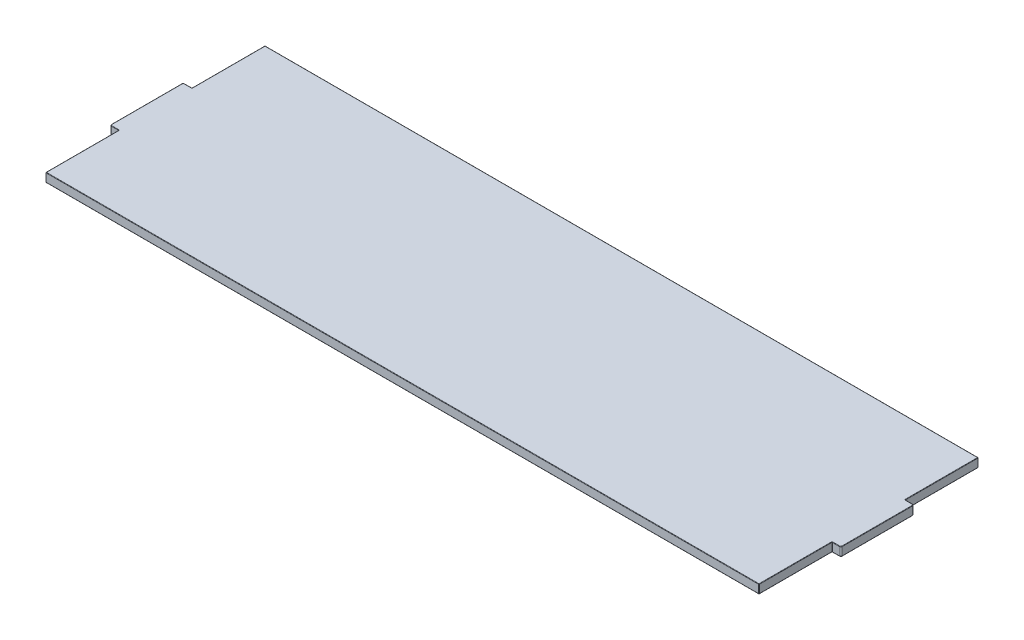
ISO-10303-21;
HEADER;
FILE_DESCRIPTION(('STEP AP214'),'2;1');
FILE_NAME('part.step','',(''),(''),'','','');
FILE_SCHEMA(('AUTOMOTIVE_DESIGN { 1 0 10303 214 1 1 1 1 }'));
ENDSEC;
DATA;
#1=APPLICATION_CONTEXT('core data for automotive mechanical design processes');
#2=APPLICATION_PROTOCOL_DEFINITION('international standard','automotive_design',2000,#1);
#3=PRODUCT_CONTEXT('',#1,'mechanical');
#4=PRODUCT('Part','Part','',(#3));
#5=PRODUCT_RELATED_PRODUCT_CATEGORY('part','',(#4));
#6=PRODUCT_DEFINITION_FORMATION('','',#4);
#7=PRODUCT_DEFINITION_CONTEXT('part definition',#1,'design');
#8=PRODUCT_DEFINITION('design','',#6,#7);
#9=PRODUCT_DEFINITION_SHAPE('','',#8);
#10=(LENGTH_UNIT() NAMED_UNIT(*) SI_UNIT(.MILLI.,.METRE.));
#11=(NAMED_UNIT(*) PLANE_ANGLE_UNIT() SI_UNIT($,.RADIAN.));
#12=(NAMED_UNIT(*) SI_UNIT($,.STERADIAN.) SOLID_ANGLE_UNIT());
#13=UNCERTAINTY_MEASURE_WITH_UNIT(LENGTH_MEASURE(1.E-05),#10,'distance_accuracy_value','');
#14=(GEOMETRIC_REPRESENTATION_CONTEXT(3) GLOBAL_UNCERTAINTY_ASSIGNED_CONTEXT((#13)) GLOBAL_UNIT_ASSIGNED_CONTEXT((#10,
#11,#12)) REPRESENTATION_CONTEXT('',''));
#15=CARTESIAN_POINT('',(0.,0.,0.));
#16=DIRECTION('',(0.,0.,1.));
#17=DIRECTION('',(1.,0.,0.));
#18=AXIS2_PLACEMENT_3D('',#15,#16,#17);
#19=CARTESIAN_POINT('',(0.,12.,0.));
#20=DIRECTION('',(0.,1.,0.));
#21=DIRECTION('',(0.,0.,1.));
#22=AXIS2_PLACEMENT_3D('',#19,#20,#21);
#23=PLANE('',#22);
#24=CARTESIAN_POINT('',(488.5,12.,-50.5));
#25=DIRECTION('',(0.,1.,0.));
#26=DIRECTION('',(0.,0.,1.));
#27=AXIS2_PLACEMENT_3D('',#24,#25,#26);
#28=CIRCLE('',#27,1.);
#29=CARTESIAN_POINT('',(487.5,12.,-50.5));
#30=VERTEX_POINT('',#29);
#31=CARTESIAN_POINT('',(488.5,12.,-49.5));
#32=VERTEX_POINT('',#31);
#33=EDGE_CURVE('E11',#30,#32,#28,.T.);
#34=ORIENTED_EDGE('',*,*,#33,.F.);
#35=DIRECTION('',(0.,0.,-1.));
#36=VECTOR('',#35,1.);
#37=CARTESIAN_POINT('',(487.5,12.,-150.));
#38=LINE('',#37,#36);
#39=CARTESIAN_POINT('',(487.5,12.,-149.5));
#40=VERTEX_POINT('',#39);
#41=EDGE_CURVE('E48',#30,#40,#38,.T.);
#42=ORIENTED_EDGE('',*,*,#41,.T.);
#43=DIRECTION('',(-1.,0.,0.));
#44=VECTOR('',#43,1.);
#45=CARTESIAN_POINT('',(-488.,12.,-149.5));
#46=LINE('',#45,#44);
#47=CARTESIAN_POINT('',(-487.5,12.,-149.5));
#48=VERTEX_POINT('',#47);
#49=EDGE_CURVE('E609',#40,#48,#46,.T.);
#50=ORIENTED_EDGE('',*,*,#49,.T.);
#51=DIRECTION('',(0.,0.,1.));
#52=VECTOR('',#51,1.);
#53=CARTESIAN_POINT('',(-487.5,12.,-50.));
#54=LINE('',#53,#52);
#55=CARTESIAN_POINT('',(-487.5,12.,-50.5));
#56=VERTEX_POINT('',#55);
#57=EDGE_CURVE('E592',#48,#56,#54,.T.);
#58=ORIENTED_EDGE('',*,*,#57,.T.);
#59=CARTESIAN_POINT('',(-488.5,12.,-50.5));
#60=DIRECTION('',(0.,1.,0.));
#61=DIRECTION('',(0.,0.,1.));
#62=AXIS2_PLACEMENT_3D('',#59,#60,#61);
#63=CIRCLE('',#62,1.);
#64=CARTESIAN_POINT('',(-488.5,12.,-49.5));
#65=VERTEX_POINT('',#64);
#66=EDGE_CURVE('E589',#65,#56,#63,.T.);
#67=ORIENTED_EDGE('',*,*,#66,.F.);
#68=DIRECTION('',(-1.,0.,0.));
#69=VECTOR('',#68,1.);
#70=CARTESIAN_POINT('',(-498.,12.,-49.5));
#71=LINE('',#70,#69);
#72=CARTESIAN_POINT('',(-498.,12.,-49.5));
#73=VERTEX_POINT('',#72);
#74=EDGE_CURVE('E574',#65,#73,#71,.T.);
#75=ORIENTED_EDGE('',*,*,#74,.T.);
#76=CARTESIAN_POINT('',(-498.,12.,-48.));
#77=DIRECTION('',(0.,1.,0.));
#78=DIRECTION('',(0.,0.,1.));
#79=AXIS2_PLACEMENT_3D('',#76,#77,#78);
#80=CIRCLE('',#79,1.5);
#81=CARTESIAN_POINT('',(-499.5,12.,-48.));
#82=VERTEX_POINT('',#81);
#83=EDGE_CURVE('E577',#73,#82,#80,.T.);
#84=ORIENTED_EDGE('',*,*,#83,.T.);
#85=DIRECTION('',(0.,0.,1.));
#86=VECTOR('',#85,1.);
#87=CARTESIAN_POINT('',(-499.5,12.,48.));
#88=LINE('',#87,#86);
#89=CARTESIAN_POINT('',(-499.5,12.,48.));
#90=VERTEX_POINT('',#89);
#91=EDGE_CURVE('E580',#82,#90,#88,.T.);
#92=ORIENTED_EDGE('',*,*,#91,.T.);
#93=CARTESIAN_POINT('',(-498.,12.,48.));
#94=DIRECTION('',(0.,1.,0.));
#95=DIRECTION('',(0.,0.,1.));
#96=AXIS2_PLACEMENT_3D('',#93,#94,#95);
#97=CIRCLE('',#96,1.5);
#98=CARTESIAN_POINT('',(-498.,12.,49.5));
#99=VERTEX_POINT('',#98);
#100=EDGE_CURVE('E583',#90,#99,#97,.T.);
#101=ORIENTED_EDGE('',*,*,#100,.T.);
#102=DIRECTION('',(1.,0.,0.));
#103=VECTOR('',#102,1.);
#104=CARTESIAN_POINT('',(-488.,12.,49.5));
#105=LINE('',#104,#103);
#106=CARTESIAN_POINT('',(-488.5,12.,49.5));
#107=VERTEX_POINT('',#106);
#108=EDGE_CURVE('E586',#99,#107,#105,.T.);
#109=ORIENTED_EDGE('',*,*,#108,.T.);
#110=CARTESIAN_POINT('',(-488.5,12.,50.5));
#111=DIRECTION('',(0.,1.,0.));
#112=DIRECTION('',(0.,0.,1.));
#113=AXIS2_PLACEMENT_3D('',#110,#111,#112);
#114=CIRCLE('',#113,1.);
#115=CARTESIAN_POINT('',(-487.5,12.,50.5));
#116=VERTEX_POINT('',#115);
#117=EDGE_CURVE('E596',#116,#107,#114,.T.);
#118=ORIENTED_EDGE('',*,*,#117,.F.);
#119=DIRECTION('',(0.,0.,1.));
#120=VECTOR('',#119,1.);
#121=CARTESIAN_POINT('',(-487.5,12.,150.));
#122=LINE('',#121,#120);
#123=CARTESIAN_POINT('',(-487.5,12.,149.5));
#124=VERTEX_POINT('',#123);
#125=EDGE_CURVE('E600',#116,#124,#122,.T.);
#126=ORIENTED_EDGE('',*,*,#125,.T.);
#127=DIRECTION('',(1.,0.,0.));
#128=VECTOR('',#127,1.);
#129=CARTESIAN_POINT('',(488.,12.,149.5));
#130=LINE('',#129,#128);
#131=CARTESIAN_POINT('',(487.5,12.,149.5));
#132=VERTEX_POINT('',#131);
#133=EDGE_CURVE('E603',#124,#132,#130,.T.);
#134=ORIENTED_EDGE('',*,*,#133,.T.);
#135=DIRECTION('',(0.,0.,-1.));
#136=VECTOR('',#135,1.);
#137=CARTESIAN_POINT('',(487.5,12.,50.));
#138=LINE('',#137,#136);
#139=CARTESIAN_POINT('',(487.5,12.,50.5));
#140=VERTEX_POINT('',#139);
#141=EDGE_CURVE('E606',#132,#140,#138,.T.);
#142=ORIENTED_EDGE('',*,*,#141,.T.);
#143=CARTESIAN_POINT('',(488.5,12.,50.5));
#144=DIRECTION('',(0.,1.,0.));
#145=DIRECTION('',(0.,0.,1.));
#146=AXIS2_PLACEMENT_3D('',#143,#144,#145);
#147=CIRCLE('',#146,1.);
#148=CARTESIAN_POINT('',(488.5,12.,49.5));
#149=VERTEX_POINT('',#148);
#150=EDGE_CURVE('E612',#149,#140,#147,.T.);
#151=ORIENTED_EDGE('',*,*,#150,.F.);
#152=DIRECTION('',(1.,0.,0.));
#153=VECTOR('',#152,1.);
#154=CARTESIAN_POINT('',(498.,12.,49.4999999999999));
#155=LINE('',#154,#153);
#156=CARTESIAN_POINT('',(498.,12.,49.4999999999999));
#157=VERTEX_POINT('',#156);
#158=EDGE_CURVE('E616',#149,#157,#155,.T.);
#159=ORIENTED_EDGE('',*,*,#158,.T.);
#160=CARTESIAN_POINT('',(498.,12.,47.9999999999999));
#161=DIRECTION('',(0.,1.,0.));
#162=DIRECTION('',(0.,0.,1.));
#163=AXIS2_PLACEMENT_3D('',#160,#161,#162);
#164=CIRCLE('',#163,1.5);
#165=CARTESIAN_POINT('',(499.5,12.,47.9999999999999));
#166=VERTEX_POINT('',#165);
#167=EDGE_CURVE('E619',#157,#166,#164,.T.);
#168=ORIENTED_EDGE('',*,*,#167,.T.);
#169=DIRECTION('',(0.,0.,-1.));
#170=VECTOR('',#169,1.);
#171=CARTESIAN_POINT('',(499.5,12.,-48.0000000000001));
#172=LINE('',#171,#170);
#173=CARTESIAN_POINT('',(499.5,12.,-48.0000000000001));
#174=VERTEX_POINT('',#173);
#175=EDGE_CURVE('E622',#166,#174,#172,.T.);
#176=ORIENTED_EDGE('',*,*,#175,.T.);
#177=CARTESIAN_POINT('',(498.,12.,-48.0000000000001));
#178=DIRECTION('',(0.,1.,0.));
#179=DIRECTION('',(0.,0.,1.));
#180=AXIS2_PLACEMENT_3D('',#177,#178,#179);
#181=CIRCLE('',#180,1.5);
#182=CARTESIAN_POINT('',(498.,12.,-49.5000000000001));
#183=VERTEX_POINT('',#182);
#184=EDGE_CURVE('E625',#174,#183,#181,.T.);
#185=ORIENTED_EDGE('',*,*,#184,.T.);
#186=DIRECTION('',(-1.,0.,0.));
#187=VECTOR('',#186,1.);
#188=CARTESIAN_POINT('',(488.,12.,-49.5));
#189=LINE('',#188,#187);
#190=EDGE_CURVE('E59',#183,#32,#189,.T.);
#191=ORIENTED_EDGE('',*,*,#190,.T.);
#192=EDGE_LOOP('',(#34,#42,#50,#58,#67,#75,#84,#92,#101,#109,#118,#126,#134,#142,#151,#159,#168,
#176,#185,#191));
#193=FACE_BOUND('',#192,.T.);
#194=ADVANCED_FACE('F38',(#193),#23,.T.);
#195=CARTESIAN_POINT('',(488.,12.,50.));
#196=DIRECTION('',(-1.,0.,0.));
#197=DIRECTION('',(0.,0.,1.));
#198=AXIS2_PLACEMENT_3D('',#195,#196,#197);
#199=PLANE('',#198);
#200=DIRECTION('',(0.,-1.,0.));
#201=VECTOR('',#200,1.);
#202=CARTESIAN_POINT('',(488.,12.,149.5));
#203=LINE('',#202,#201);
#204=CARTESIAN_POINT('',(488.,11.5,149.5));
#205=VERTEX_POINT('',#204);
#206=CARTESIAN_POINT('',(488.,0.5,149.5));
#207=VERTEX_POINT('',#206);
#208=EDGE_CURVE('E417',#205,#207,#203,.T.);
#209=ORIENTED_EDGE('',*,*,#208,.T.);
#210=DIRECTION('',(0.,0.,-1.));
#211=VECTOR('',#210,1.);
#212=CARTESIAN_POINT('',(488.,0.5,50.));
#213=LINE('',#212,#211);
#214=CARTESIAN_POINT('',(488.,0.5,50.5));
#215=VERTEX_POINT('',#214);
#216=EDGE_CURVE('E424',#207,#215,#213,.T.);
#217=ORIENTED_EDGE('',*,*,#216,.T.);
#218=DIRECTION('',(0.,-1.,0.));
#219=VECTOR('',#218,1.);
#220=CARTESIAN_POINT('',(488.,12.,50.5));
#221=LINE('',#220,#219);
#222=CARTESIAN_POINT('',(488.,11.5,50.5));
#223=VERTEX_POINT('',#222);
#224=EDGE_CURVE('E420',#215,#223,#221,.F.);
#225=ORIENTED_EDGE('',*,*,#224,.T.);
#226=DIRECTION('',(0.,0.,-1.));
#227=VECTOR('',#226,1.);
#228=CARTESIAN_POINT('',(488.,11.5,150.));
#229=LINE('',#228,#227);
#230=EDGE_CURVE('E414',#223,#205,#229,.F.);
#231=ORIENTED_EDGE('',*,*,#230,.T.);
#232=EDGE_LOOP('',(#209,#217,#225,#231));
#233=FACE_BOUND('',#232,.T.);
#234=ADVANCED_FACE('F994',(#233),#199,.F.);
#235=CARTESIAN_POINT('',(500.,12.,49.9999999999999));
#236=DIRECTION('',(0.,0.,-1.));
#237=DIRECTION('',(-1.,0.,0.));
#238=AXIS2_PLACEMENT_3D('',#235,#236,#237);
#239=PLANE('',#238);
#240=DIRECTION('',(0.,-1.,0.));
#241=VECTOR('',#240,1.);
#242=CARTESIAN_POINT('',(488.5,0.,50.));
#243=LINE('',#242,#241);
#244=CARTESIAN_POINT('',(488.5,11.5,50.));
#245=VERTEX_POINT('',#244);
#246=CARTESIAN_POINT('',(488.5,0.5,50.));
#247=VERTEX_POINT('',#246);
#248=EDGE_CURVE('E407',#245,#247,#243,.T.);
#249=ORIENTED_EDGE('',*,*,#248,.T.);
#250=DIRECTION('',(1.,0.,0.));
#251=VECTOR('',#250,1.);
#252=CARTESIAN_POINT('',(500.,0.5,49.9999999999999));
#253=LINE('',#252,#251);
#254=CARTESIAN_POINT('',(498.,0.5,49.9999999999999));
#255=VERTEX_POINT('',#254);
#256=EDGE_CURVE('E411',#247,#255,#253,.T.);
#257=ORIENTED_EDGE('',*,*,#256,.T.);
#258=DIRECTION('',(0.,-1.,0.));
#259=VECTOR('',#258,1.);
#260=CARTESIAN_POINT('',(498.,12.,49.9999999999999));
#261=LINE('',#260,#259);
#262=CARTESIAN_POINT('',(498.,11.5,49.9999999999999));
#263=VERTEX_POINT('',#262);
#264=EDGE_CURVE('E360',#255,#263,#261,.F.);
#265=ORIENTED_EDGE('',*,*,#264,.T.);
#266=DIRECTION('',(1.,0.,0.));
#267=VECTOR('',#266,1.);
#268=CARTESIAN_POINT('',(488.,11.5,50.));
#269=LINE('',#268,#267);
#270=EDGE_CURVE('E404',#263,#245,#269,.F.);
#271=ORIENTED_EDGE('',*,*,#270,.T.);
#272=EDGE_LOOP('',(#249,#257,#265,#271));
#273=FACE_BOUND('',#272,.T.);
#274=ADVANCED_FACE('F926',(#273),#239,.F.);
#275=CARTESIAN_POINT('',(500.,12.,-50.0000000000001));
#276=DIRECTION('',(-1.,0.,0.));
#277=DIRECTION('',(0.,0.,1.));
#278=AXIS2_PLACEMENT_3D('',#275,#276,#277);
#279=PLANE('',#278);
#280=DIRECTION('',(0.,-1.,0.));
#281=VECTOR('',#280,1.);
#282=CARTESIAN_POINT('',(500.,12.,47.9999999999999));
#283=LINE('',#282,#281);
#284=CARTESIAN_POINT('',(500.,11.5,47.9999999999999));
#285=VERTEX_POINT('',#284);
#286=CARTESIAN_POINT('',(500.,0.5,47.9999999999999));
#287=VERTEX_POINT('',#286);
#288=EDGE_CURVE('E893',#285,#287,#283,.T.);
#289=ORIENTED_EDGE('',*,*,#288,.T.);
#290=DIRECTION('',(0.,0.,-1.));
#291=VECTOR('',#290,1.);
#292=CARTESIAN_POINT('',(500.,0.5,-50.0000000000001));
#293=LINE('',#292,#291);
#294=CARTESIAN_POINT('',(500.,0.5,-48.0000000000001));
#295=VERTEX_POINT('',#294);
#296=EDGE_CURVE('E553',#287,#295,#293,.T.);
#297=ORIENTED_EDGE('',*,*,#296,.T.);
#298=DIRECTION('',(0.,-1.,0.));
#299=VECTOR('',#298,1.);
#300=CARTESIAN_POINT('',(500.,12.,-48.0000000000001));
#301=LINE('',#300,#299);
#302=CARTESIAN_POINT('',(500.,11.5,-48.0000000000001));
#303=VERTEX_POINT('',#302);
#304=EDGE_CURVE('E364',#295,#303,#301,.F.);
#305=ORIENTED_EDGE('',*,*,#304,.T.);
#306=DIRECTION('',(0.,0.,-1.));
#307=VECTOR('',#306,1.);
#308=CARTESIAN_POINT('',(500.,11.5,47.9999999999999));
#309=LINE('',#308,#307);
#310=EDGE_CURVE('E550',#303,#285,#309,.F.);
#311=ORIENTED_EDGE('',*,*,#310,.T.);
#312=EDGE_LOOP('',(#289,#297,#305,#311));
#313=FACE_BOUND('',#312,.T.);
#314=ADVANCED_FACE('F901',(#313),#279,.F.);
#315=CARTESIAN_POINT('',(500.,12.,-50.0000000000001));
#316=DIRECTION('',(0.,0.,1.));
#317=DIRECTION('',(1.,0.,0.));
#318=AXIS2_PLACEMENT_3D('',#315,#316,#317);
#319=PLANE('',#318);
#320=DIRECTION('',(0.,-1.,0.));
#321=VECTOR('',#320,1.);
#322=CARTESIAN_POINT('',(498.,12.,-50.0000000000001));
#323=LINE('',#322,#321);
#324=CARTESIAN_POINT('',(498.,11.5,-50.0000000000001));
#325=VERTEX_POINT('',#324);
#326=CARTESIAN_POINT('',(498.,0.5,-50.0000000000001));
#327=VERTEX_POINT('',#326);
#328=EDGE_CURVE('E889',#325,#327,#323,.T.);
#329=ORIENTED_EDGE('',*,*,#328,.T.);
#330=DIRECTION('',(-1.,0.,0.));
#331=VECTOR('',#330,1.);
#332=CARTESIAN_POINT('',(500.,0.5,-50.0000000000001));
#333=LINE('',#332,#331);
#334=CARTESIAN_POINT('',(488.5,0.5,-50.));
#335=VERTEX_POINT('',#334);
#336=EDGE_CURVE('E446',#327,#335,#333,.T.);
#337=ORIENTED_EDGE('',*,*,#336,.T.);
#338=DIRECTION('',(0.,-1.,0.));
#339=VECTOR('',#338,1.);
#340=CARTESIAN_POINT('',(488.5,12.,-50.));
#341=LINE('',#340,#339);
#342=CARTESIAN_POINT('',(488.5,11.5,-50.));
#343=VERTEX_POINT('',#342);
#344=EDGE_CURVE('E443',#335,#343,#341,.F.);
#345=ORIENTED_EDGE('',*,*,#344,.T.);
#346=DIRECTION('',(-1.,0.,0.));
#347=VECTOR('',#346,1.);
#348=CARTESIAN_POINT('',(498.,11.5,-50.0000000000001));
#349=LINE('',#348,#347);
#350=EDGE_CURVE('E440',#343,#325,#349,.F.);
#351=ORIENTED_EDGE('',*,*,#350,.T.);
#352=EDGE_LOOP('',(#329,#337,#345,#351));
#353=FACE_BOUND('',#352,.T.);
#354=ADVANCED_FACE('F951',(#353),#319,.F.);
#355=CARTESIAN_POINT('',(488.,12.,-150.));
#356=DIRECTION('',(-1.,0.,0.));
#357=DIRECTION('',(0.,0.,1.));
#358=AXIS2_PLACEMENT_3D('',#355,#356,#357);
#359=PLANE('',#358);
#360=DIRECTION('',(0.,-1.,0.));
#361=VECTOR('',#360,1.);
#362=CARTESIAN_POINT('',(488.,0.,-50.5));
#363=LINE('',#362,#361);
#364=CARTESIAN_POINT('',(488.,11.5,-50.5));
#365=VERTEX_POINT('',#364);
#366=CARTESIAN_POINT('',(488.,0.5,-50.5));
#367=VERTEX_POINT('',#366);
#368=EDGE_CURVE('E433',#365,#367,#363,.T.);
#369=ORIENTED_EDGE('',*,*,#368,.T.);
#370=DIRECTION('',(0.,0.,-1.));
#371=VECTOR('',#370,1.);
#372=CARTESIAN_POINT('',(488.,0.5,-150.));
#373=LINE('',#372,#371);
#374=CARTESIAN_POINT('',(488.,0.5,-149.5));
#375=VERTEX_POINT('',#374);
#376=EDGE_CURVE('E437',#367,#375,#373,.T.);
#377=ORIENTED_EDGE('',*,*,#376,.T.);
#378=DIRECTION('',(0.,-1.,0.));
#379=VECTOR('',#378,1.);
#380=CARTESIAN_POINT('',(488.,12.,-149.5));
#381=LINE('',#380,#379);
#382=CARTESIAN_POINT('',(488.,11.5,-149.5));
#383=VERTEX_POINT('',#382);
#384=EDGE_CURVE('E430',#375,#383,#381,.F.);
#385=ORIENTED_EDGE('',*,*,#384,.T.);
#386=DIRECTION('',(0.,0.,-1.));
#387=VECTOR('',#386,1.);
#388=CARTESIAN_POINT('',(488.,11.5,-50.));
#389=LINE('',#388,#387);
#390=EDGE_CURVE('E427',#383,#365,#389,.F.);
#391=ORIENTED_EDGE('',*,*,#390,.T.);
#392=EDGE_LOOP('',(#369,#377,#385,#391));
#393=FACE_BOUND('',#392,.T.);
#394=ADVANCED_FACE('F965',(#393),#359,.F.);
#395=CARTESIAN_POINT('',(-488.,12.,-150.));
#396=DIRECTION('',(0.,0.,1.));
#397=DIRECTION('',(1.,0.,0.));
#398=AXIS2_PLACEMENT_3D('',#395,#396,#397);
#399=PLANE('',#398);
#400=DIRECTION('',(0.,-1.,0.));
#401=VECTOR('',#400,1.);
#402=CARTESIAN_POINT('',(487.5,12.,-150.));
#403=LINE('',#402,#401);
#404=CARTESIAN_POINT('',(487.5,11.5,-150.));
#405=VERTEX_POINT('',#404);
#406=CARTESIAN_POINT('',(487.5,0.5,-150.));
#407=VERTEX_POINT('',#406);
#408=EDGE_CURVE('E455',#405,#407,#403,.T.);
#409=ORIENTED_EDGE('',*,*,#408,.T.);
#410=DIRECTION('',(-1.,0.,0.));
#411=VECTOR('',#410,1.);
#412=CARTESIAN_POINT('',(-488.,0.5,-150.));
#413=LINE('',#412,#411);
#414=CARTESIAN_POINT('',(-487.5,0.5,-150.));
#415=VERTEX_POINT('',#414);
#416=EDGE_CURVE('E459',#407,#415,#413,.T.);
#417=ORIENTED_EDGE('',*,*,#416,.T.);
#418=DIRECTION('',(0.,-1.,0.));
#419=VECTOR('',#418,1.);
#420=CARTESIAN_POINT('',(-487.5,12.,-150.));
#421=LINE('',#420,#419);
#422=CARTESIAN_POINT('',(-487.5,11.5,-150.));
#423=VERTEX_POINT('',#422);
#424=EDGE_CURVE('E452',#415,#423,#421,.F.);
#425=ORIENTED_EDGE('',*,*,#424,.T.);
#426=DIRECTION('',(-1.,0.,0.));
#427=VECTOR('',#426,1.);
#428=CARTESIAN_POINT('',(488.,11.5,-150.));
#429=LINE('',#428,#427);
#430=EDGE_CURVE('E449',#423,#405,#429,.F.);
#431=ORIENTED_EDGE('',*,*,#430,.T.);
#432=EDGE_LOOP('',(#409,#417,#425,#431));
#433=FACE_BOUND('',#432,.T.);
#434=ADVANCED_FACE('F1026',(#433),#399,.F.);
#435=CARTESIAN_POINT('',(-488.,12.,-150.));
#436=DIRECTION('',(1.,0.,0.));
#437=DIRECTION('',(0.,0.,-1.));
#438=AXIS2_PLACEMENT_3D('',#435,#436,#437);
#439=PLANE('',#438);
#440=DIRECTION('',(0.,-1.,0.));
#441=VECTOR('',#440,1.);
#442=CARTESIAN_POINT('',(-488.,12.,-149.5));
#443=LINE('',#442,#441);
#444=CARTESIAN_POINT('',(-488.,11.5,-149.5));
#445=VERTEX_POINT('',#444);
#446=CARTESIAN_POINT('',(-488.,0.5,-149.5));
#447=VERTEX_POINT('',#446);
#448=EDGE_CURVE('E394',#445,#447,#443,.T.);
#449=ORIENTED_EDGE('',*,*,#448,.T.);
#450=DIRECTION('',(0.,0.,1.));
#451=VECTOR('',#450,1.);
#452=CARTESIAN_POINT('',(-488.,0.5,-150.));
#453=LINE('',#452,#451);
#454=CARTESIAN_POINT('',(-488.,0.5,-50.5));
#455=VERTEX_POINT('',#454);
#456=EDGE_CURVE('E401',#447,#455,#453,.T.);
#457=ORIENTED_EDGE('',*,*,#456,.T.);
#458=DIRECTION('',(0.,-1.,0.));
#459=VECTOR('',#458,1.);
#460=CARTESIAN_POINT('',(-488.,12.,-50.5));
#461=LINE('',#460,#459);
#462=CARTESIAN_POINT('',(-488.,11.5,-50.5));
#463=VERTEX_POINT('',#462);
#464=EDGE_CURVE('E397',#455,#463,#461,.F.);
#465=ORIENTED_EDGE('',*,*,#464,.T.);
#466=DIRECTION('',(0.,0.,1.));
#467=VECTOR('',#466,1.);
#468=CARTESIAN_POINT('',(-488.,11.5,-150.));
#469=LINE('',#468,#467);
#470=EDGE_CURVE('E391',#463,#445,#469,.F.);
#471=ORIENTED_EDGE('',*,*,#470,.T.);
#472=EDGE_LOOP('',(#449,#457,#465,#471));
#473=FACE_BOUND('',#472,.T.);
#474=ADVANCED_FACE('F1022',(#473),#439,.F.);
#475=CARTESIAN_POINT('',(-500.,12.,-50.));
#476=DIRECTION('',(0.,0.,1.));
#477=DIRECTION('',(1.,0.,0.));
#478=AXIS2_PLACEMENT_3D('',#475,#476,#477);
#479=PLANE('',#478);
#480=DIRECTION('',(0.,-1.,0.));
#481=VECTOR('',#480,1.);
#482=CARTESIAN_POINT('',(-488.5,0.,-50.));
#483=LINE('',#482,#481);
#484=CARTESIAN_POINT('',(-488.5,11.5,-50.));
#485=VERTEX_POINT('',#484);
#486=CARTESIAN_POINT('',(-488.5,0.5,-50.));
#487=VERTEX_POINT('',#486);
#488=EDGE_CURVE('E385',#485,#487,#483,.T.);
#489=ORIENTED_EDGE('',*,*,#488,.T.);
#490=DIRECTION('',(-1.,0.,0.));
#491=VECTOR('',#490,1.);
#492=CARTESIAN_POINT('',(-500.,0.5,-50.));
#493=LINE('',#492,#491);
#494=CARTESIAN_POINT('',(-498.,0.5,-50.));
#495=VERTEX_POINT('',#494);
#496=EDGE_CURVE('E388',#487,#495,#493,.T.);
#497=ORIENTED_EDGE('',*,*,#496,.T.);
#498=DIRECTION('',(0.,-1.,0.));
#499=VECTOR('',#498,1.);
#500=CARTESIAN_POINT('',(-498.,12.,-50.));
#501=LINE('',#500,#499);
#502=CARTESIAN_POINT('',(-498.,11.5,-50.));
#503=VERTEX_POINT('',#502);
#504=EDGE_CURVE('E879',#495,#503,#501,.F.);
#505=ORIENTED_EDGE('',*,*,#504,.T.);
#506=DIRECTION('',(-1.,0.,0.));
#507=VECTOR('',#506,1.);
#508=CARTESIAN_POINT('',(-488.,11.5,-50.));
#509=LINE('',#508,#507);
#510=EDGE_CURVE('E382',#503,#485,#509,.F.);
#511=ORIENTED_EDGE('',*,*,#510,.T.);
#512=EDGE_LOOP('',(#489,#497,#505,#511));
#513=FACE_BOUND('',#512,.T.);
#514=ADVANCED_FACE('F1019',(#513),#479,.F.);
#515=CARTESIAN_POINT('',(-500.,12.,-50.));
#516=DIRECTION('',(1.,0.,0.));
#517=DIRECTION('',(0.,0.,-1.));
#518=AXIS2_PLACEMENT_3D('',#515,#516,#517);
#519=PLANE('',#518);
#520=DIRECTION('',(0.,-1.,0.));
#521=VECTOR('',#520,1.);
#522=CARTESIAN_POINT('',(-500.,12.,-48.));
#523=LINE('',#522,#521);
#524=CARTESIAN_POINT('',(-500.,11.5,-48.));
#525=VERTEX_POINT('',#524);
#526=CARTESIAN_POINT('',(-500.,0.5,-48.));
#527=VERTEX_POINT('',#526);
#528=EDGE_CURVE('E872',#525,#527,#523,.T.);
#529=ORIENTED_EDGE('',*,*,#528,.T.);
#530=DIRECTION('',(0.,0.,1.));
#531=VECTOR('',#530,1.);
#532=CARTESIAN_POINT('',(-500.,0.5,-50.));
#533=LINE('',#532,#531);
#534=CARTESIAN_POINT('',(-500.,0.5,48.));
#535=VERTEX_POINT('',#534);
#536=EDGE_CURVE('E571',#527,#535,#533,.T.);
#537=ORIENTED_EDGE('',*,*,#536,.T.);
#538=DIRECTION('',(0.,-1.,0.));
#539=VECTOR('',#538,1.);
#540=CARTESIAN_POINT('',(-500.,12.,48.));
#541=LINE('',#540,#539);
#542=CARTESIAN_POINT('',(-500.,11.5,48.));
#543=VERTEX_POINT('',#542);
#544=EDGE_CURVE('E866',#535,#543,#541,.F.);
#545=ORIENTED_EDGE('',*,*,#544,.T.);
#546=DIRECTION('',(0.,0.,1.));
#547=VECTOR('',#546,1.);
#548=CARTESIAN_POINT('',(-500.,11.5,-48.));
#549=LINE('',#548,#547);
#550=EDGE_CURVE('E568',#543,#525,#549,.F.);
#551=ORIENTED_EDGE('',*,*,#550,.T.);
#552=EDGE_LOOP('',(#529,#537,#545,#551));
#553=FACE_BOUND('',#552,.T.);
#554=ADVANCED_FACE('F1015',(#553),#519,.F.);
#555=CARTESIAN_POINT('',(-500.,12.,50.));
#556=DIRECTION('',(0.,0.,-1.));
#557=DIRECTION('',(-1.,0.,0.));
#558=AXIS2_PLACEMENT_3D('',#555,#556,#557);
#559=PLANE('',#558);
#560=DIRECTION('',(0.,-1.,0.));
#561=VECTOR('',#560,1.);
#562=CARTESIAN_POINT('',(-498.,12.,50.));
#563=LINE('',#562,#561);
#564=CARTESIAN_POINT('',(-498.,11.5,50.));
#565=VERTEX_POINT('',#564);
#566=CARTESIAN_POINT('',(-498.,0.5,50.));
#567=VERTEX_POINT('',#566);
#568=EDGE_CURVE('E885',#565,#567,#563,.T.);
#569=ORIENTED_EDGE('',*,*,#568,.T.);
#570=DIRECTION('',(1.,0.,0.));
#571=VECTOR('',#570,1.);
#572=CARTESIAN_POINT('',(-500.,0.5,50.));
#573=LINE('',#572,#571);
#574=CARTESIAN_POINT('',(-488.5,0.5,50.));
#575=VERTEX_POINT('',#574);
#576=EDGE_CURVE('E379',#567,#575,#573,.T.);
#577=ORIENTED_EDGE('',*,*,#576,.T.);
#578=DIRECTION('',(0.,-1.,0.));
#579=VECTOR('',#578,1.);
#580=CARTESIAN_POINT('',(-488.5,12.,50.));
#581=LINE('',#580,#579);
#582=CARTESIAN_POINT('',(-488.5,11.5,50.));
#583=VERTEX_POINT('',#582);
#584=EDGE_CURVE('E375',#575,#583,#581,.F.);
#585=ORIENTED_EDGE('',*,*,#584,.T.);
#586=DIRECTION('',(1.,0.,0.));
#587=VECTOR('',#586,1.);
#588=CARTESIAN_POINT('',(-498.,11.5,50.));
#589=LINE('',#588,#587);
#590=EDGE_CURVE('E372',#583,#565,#589,.F.);
#591=ORIENTED_EDGE('',*,*,#590,.T.);
#592=EDGE_LOOP('',(#569,#577,#585,#591));
#593=FACE_BOUND('',#592,.T.);
#594=ADVANCED_FACE('F1012',(#593),#559,.F.);
#595=CARTESIAN_POINT('',(-488.,12.,50.));
#596=DIRECTION('',(1.,0.,0.));
#597=DIRECTION('',(0.,0.,-1.));
#598=AXIS2_PLACEMENT_3D('',#595,#596,#597);
#599=PLANE('',#598);
#600=DIRECTION('',(0.,-1.,0.));
#601=VECTOR('',#600,1.);
#602=CARTESIAN_POINT('',(-488.,0.,50.5));
#603=LINE('',#602,#601);
#604=CARTESIAN_POINT('',(-488.,11.5,50.5));
#605=VERTEX_POINT('',#604);
#606=CARTESIAN_POINT('',(-488.,0.5,50.5));
#607=VERTEX_POINT('',#606);
#608=EDGE_CURVE('E330',#605,#607,#603,.T.);
#609=ORIENTED_EDGE('',*,*,#608,.T.);
#610=DIRECTION('',(0.,0.,1.));
#611=VECTOR('',#610,1.);
#612=CARTESIAN_POINT('',(-488.,0.5,50.));
#613=LINE('',#612,#611);
#614=CARTESIAN_POINT('',(-488.,0.5,149.5));
#615=VERTEX_POINT('',#614);
#616=EDGE_CURVE('E325',#607,#615,#613,.T.);
#617=ORIENTED_EDGE('',*,*,#616,.T.);
#618=DIRECTION('',(0.,-1.,0.));
#619=VECTOR('',#618,1.);
#620=CARTESIAN_POINT('',(-488.,12.,149.5));
#621=LINE('',#620,#619);
#622=CARTESIAN_POINT('',(-488.,11.5,149.5));
#623=VERTEX_POINT('',#622);
#624=EDGE_CURVE('E317',#615,#623,#621,.F.);
#625=ORIENTED_EDGE('',*,*,#624,.T.);
#626=DIRECTION('',(0.,0.,1.));
#627=VECTOR('',#626,1.);
#628=CARTESIAN_POINT('',(-488.,11.5,50.));
#629=LINE('',#628,#627);
#630=EDGE_CURVE('E322',#623,#605,#629,.F.);
#631=ORIENTED_EDGE('',*,*,#630,.T.);
#632=EDGE_LOOP('',(#609,#617,#625,#631));
#633=FACE_BOUND('',#632,.T.);
#634=ADVANCED_FACE('F320',(#633),#599,.F.);
#635=CARTESIAN_POINT('',(-488.,12.,150.));
#636=DIRECTION('',(0.,0.,-1.));
#637=DIRECTION('',(-1.,0.,0.));
#638=AXIS2_PLACEMENT_3D('',#635,#636,#637);
#639=PLANE('',#638);
#640=DIRECTION('',(0.,-1.,0.));
#641=VECTOR('',#640,1.);
#642=CARTESIAN_POINT('',(-487.5,12.,150.));
#643=LINE('',#642,#641);
#644=CARTESIAN_POINT('',(-487.5,11.5,150.));
#645=VERTEX_POINT('',#644);
#646=CARTESIAN_POINT('',(-487.5,0.5,150.));
#647=VERTEX_POINT('',#646);
#648=EDGE_CURVE('E338',#645,#647,#643,.T.);
#649=ORIENTED_EDGE('',*,*,#648,.T.);
#650=DIRECTION('',(1.,0.,0.));
#651=VECTOR('',#650,1.);
#652=CARTESIAN_POINT('',(-488.,0.5,150.));
#653=LINE('',#652,#651);
#654=CARTESIAN_POINT('',(487.5,0.5,150.));
#655=VERTEX_POINT('',#654);
#656=EDGE_CURVE('E470',#647,#655,#653,.T.);
#657=ORIENTED_EDGE('',*,*,#656,.T.);
#658=DIRECTION('',(0.,-1.,0.));
#659=VECTOR('',#658,1.);
#660=CARTESIAN_POINT('',(487.5,12.,150.));
#661=LINE('',#660,#659);
#662=CARTESIAN_POINT('',(487.5,11.5,150.));
#663=VERTEX_POINT('',#662);
#664=EDGE_CURVE('E465',#655,#663,#661,.F.);
#665=ORIENTED_EDGE('',*,*,#664,.T.);
#666=DIRECTION('',(1.,0.,0.));
#667=VECTOR('',#666,1.);
#668=CARTESIAN_POINT('',(-488.,11.5,150.));
#669=LINE('',#668,#667);
#670=EDGE_CURVE('E462',#663,#645,#669,.F.);
#671=ORIENTED_EDGE('',*,*,#670,.T.);
#672=EDGE_LOOP('',(#649,#657,#665,#671));
#673=FACE_BOUND('',#672,.T.);
#674=ADVANCED_FACE('F1006',(#673),#639,.F.);
#675=CARTESIAN_POINT('',(0.,0.,0.));
#676=DIRECTION('',(0.,1.,0.));
#677=DIRECTION('',(0.,0.,1.));
#678=AXIS2_PLACEMENT_3D('',#675,#676,#677);
#679=PLANE('',#678);
#680=DIRECTION('',(0.,0.,-1.));
#681=VECTOR('',#680,1.);
#682=CARTESIAN_POINT('',(487.5,0.,8.11850586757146E-13));
#683=LINE('',#682,#681);
#684=CARTESIAN_POINT('',(487.5,0.,50.5));
#685=VERTEX_POINT('',#684);
#686=CARTESIAN_POINT('',(487.5,0.,149.5));
#687=VERTEX_POINT('',#686);
#688=EDGE_CURVE('E532',#685,#687,#683,.F.);
#689=ORIENTED_EDGE('',*,*,#688,.T.);
#690=DIRECTION('',(1.,0.,0.));
#691=VECTOR('',#690,1.);
#692=CARTESIAN_POINT('',(0.,0.,149.5));
#693=LINE('',#692,#691);
#694=CARTESIAN_POINT('',(-487.5,0.,149.5));
#695=VERTEX_POINT('',#694);
#696=EDGE_CURVE('E535',#687,#695,#693,.F.);
#697=ORIENTED_EDGE('',*,*,#696,.T.);
#698=DIRECTION('',(0.,0.,1.));
#699=VECTOR('',#698,1.);
#700=CARTESIAN_POINT('',(-487.5,0.,0.));
#701=LINE('',#700,#699);
#702=CARTESIAN_POINT('',(-487.5,0.,50.5));
#703=VERTEX_POINT('',#702);
#704=EDGE_CURVE('E525',#695,#703,#701,.F.);
#705=ORIENTED_EDGE('',*,*,#704,.T.);
#706=CARTESIAN_POINT('',(-488.5,0.,50.5));
#707=DIRECTION('',(0.,1.,0.));
#708=DIRECTION('',(0.,0.,1.));
#709=AXIS2_PLACEMENT_3D('',#706,#707,#708);
#710=CIRCLE('',#709,1.);
#711=CARTESIAN_POINT('',(-488.5,0.,49.5));
#712=VERTEX_POINT('',#711);
#713=EDGE_CURVE('E521',#712,#703,#710,.F.);
#714=ORIENTED_EDGE('',*,*,#713,.F.);
#715=DIRECTION('',(1.,0.,0.));
#716=VECTOR('',#715,1.);
#717=CARTESIAN_POINT('',(0.,0.,49.4999999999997));
#718=LINE('',#717,#716);
#719=CARTESIAN_POINT('',(-498.,0.,49.5));
#720=VERTEX_POINT('',#719);
#721=EDGE_CURVE('E499',#712,#720,#718,.F.);
#722=ORIENTED_EDGE('',*,*,#721,.T.);
#723=CARTESIAN_POINT('',(-498.,0.,48.));
#724=DIRECTION('',(0.,1.,0.));
#725=DIRECTION('',(0.,0.,1.));
#726=AXIS2_PLACEMENT_3D('',#723,#724,#725);
#727=CIRCLE('',#726,1.5);
#728=CARTESIAN_POINT('',(-499.5,0.,48.));
#729=VERTEX_POINT('',#728);
#730=EDGE_CURVE('E482',#720,#729,#727,.F.);
#731=ORIENTED_EDGE('',*,*,#730,.T.);
#732=DIRECTION('',(0.,0.,1.));
#733=VECTOR('',#732,1.);
#734=CARTESIAN_POINT('',(-499.5,0.,0.));
#735=LINE('',#734,#733);
#736=CARTESIAN_POINT('',(-499.5,0.,-48.));
#737=VERTEX_POINT('',#736);
#738=EDGE_CURVE('E473',#729,#737,#735,.F.);
#739=ORIENTED_EDGE('',*,*,#738,.T.);
#740=CARTESIAN_POINT('',(-498.,0.,-48.));
#741=DIRECTION('',(0.,1.,0.));
#742=DIRECTION('',(0.,0.,1.));
#743=AXIS2_PLACEMENT_3D('',#740,#741,#742);
#744=CIRCLE('',#743,1.5);
#745=CARTESIAN_POINT('',(-498.,0.,-49.5));
#746=VERTEX_POINT('',#745);
#747=EDGE_CURVE('E476',#737,#746,#744,.F.);
#748=ORIENTED_EDGE('',*,*,#747,.T.);
#749=DIRECTION('',(-1.,0.,0.));
#750=VECTOR('',#749,1.);
#751=CARTESIAN_POINT('',(0.,0.,-49.5));
#752=LINE('',#751,#750);
#753=CARTESIAN_POINT('',(-488.5,0.,-49.5));
#754=VERTEX_POINT('',#753);
#755=EDGE_CURVE('E479',#746,#754,#752,.F.);
#756=ORIENTED_EDGE('',*,*,#755,.T.);
#757=CARTESIAN_POINT('',(-488.5,0.,-50.5));
#758=DIRECTION('',(0.,1.,0.));
#759=DIRECTION('',(0.,0.,1.));
#760=AXIS2_PLACEMENT_3D('',#757,#758,#759);
#761=CIRCLE('',#760,1.);
#762=CARTESIAN_POINT('',(-487.5,0.,-50.5));
#763=VERTEX_POINT('',#762);
#764=EDGE_CURVE('E486',#763,#754,#761,.F.);
#765=ORIENTED_EDGE('',*,*,#764,.F.);
#766=DIRECTION('',(0.,0.,1.));
#767=VECTOR('',#766,1.);
#768=CARTESIAN_POINT('',(-487.5,0.,0.));
#769=LINE('',#768,#767);
#770=CARTESIAN_POINT('',(-487.5,0.,-149.5));
#771=VERTEX_POINT('',#770);
#772=EDGE_CURVE('E490',#763,#771,#769,.F.);
#773=ORIENTED_EDGE('',*,*,#772,.T.);
#774=DIRECTION('',(-1.,0.,0.));
#775=VECTOR('',#774,1.);
#776=CARTESIAN_POINT('',(0.,0.,-149.5));
#777=LINE('',#776,#775);
#778=CARTESIAN_POINT('',(487.5,0.,-149.5));
#779=VERTEX_POINT('',#778);
#780=EDGE_CURVE('E493',#771,#779,#777,.F.);
#781=ORIENTED_EDGE('',*,*,#780,.T.);
#782=DIRECTION('',(0.,0.,-1.));
#783=VECTOR('',#782,1.);
#784=CARTESIAN_POINT('',(487.5,0.,-1.08246744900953E-12));
#785=LINE('',#784,#783);
#786=CARTESIAN_POINT('',(487.5,0.,-50.5));
#787=VERTEX_POINT('',#786);
#788=EDGE_CURVE('E496',#779,#787,#785,.F.);
#789=ORIENTED_EDGE('',*,*,#788,.T.);
#790=CARTESIAN_POINT('',(488.5,0.,-50.5));
#791=DIRECTION('',(0.,1.,0.));
#792=DIRECTION('',(0.,0.,1.));
#793=AXIS2_PLACEMENT_3D('',#790,#791,#792);
#794=CIRCLE('',#793,1.);
#795=CARTESIAN_POINT('',(488.5,0.,-49.5));
#796=VERTEX_POINT('',#795);
#797=EDGE_CURVE('E502',#796,#787,#794,.F.);
#798=ORIENTED_EDGE('',*,*,#797,.F.);
#799=DIRECTION('',(-1.,0.,0.));
#800=VECTOR('',#799,1.);
#801=CARTESIAN_POINT('',(-5.15212872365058E-13,0.,-49.4999999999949));
#802=LINE('',#801,#800);
#803=CARTESIAN_POINT('',(498.,0.,-49.5000000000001));
#804=VERTEX_POINT('',#803);
#805=EDGE_CURVE('E506',#796,#804,#802,.F.);
#806=ORIENTED_EDGE('',*,*,#805,.T.);
#807=CARTESIAN_POINT('',(498.,0.,-48.0000000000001));
#808=DIRECTION('',(0.,1.,0.));
#809=DIRECTION('',(0.,0.,1.));
#810=AXIS2_PLACEMENT_3D('',#807,#808,#809);
#811=CIRCLE('',#810,1.5);
#812=CARTESIAN_POINT('',(499.5,0.,-48.0000000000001));
#813=VERTEX_POINT('',#812);
#814=EDGE_CURVE('E509',#804,#813,#811,.F.);
#815=ORIENTED_EDGE('',*,*,#814,.T.);
#816=DIRECTION('',(0.,0.,-1.));
#817=VECTOR('',#816,1.);
#818=CARTESIAN_POINT('',(499.5,0.,-1.10911280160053E-12));
#819=LINE('',#818,#817);
#820=CARTESIAN_POINT('',(499.5,0.,47.9999999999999));
#821=VERTEX_POINT('',#820);
#822=EDGE_CURVE('E512',#813,#821,#819,.F.);
#823=ORIENTED_EDGE('',*,*,#822,.T.);
#824=CARTESIAN_POINT('',(498.,0.,47.9999999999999));
#825=DIRECTION('',(0.,1.,0.));
#826=DIRECTION('',(0.,0.,1.));
#827=AXIS2_PLACEMENT_3D('',#824,#825,#826);
#828=CIRCLE('',#827,1.5);
#829=CARTESIAN_POINT('',(498.,0.,49.4999999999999));
#830=VERTEX_POINT('',#829);
#831=EDGE_CURVE('E515',#821,#830,#828,.F.);
#832=ORIENTED_EDGE('',*,*,#831,.T.);
#833=DIRECTION('',(1.,0.,0.));
#834=VECTOR('',#833,1.);
#835=CARTESIAN_POINT('',(4.8658993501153E-13,0.,49.5000000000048));
#836=LINE('',#835,#834);
#837=CARTESIAN_POINT('',(488.5,0.,49.5));
#838=VERTEX_POINT('',#837);
#839=EDGE_CURVE('E518',#830,#838,#836,.F.);
#840=ORIENTED_EDGE('',*,*,#839,.T.);
#841=CARTESIAN_POINT('',(488.5,0.,50.5));
#842=DIRECTION('',(0.,1.,0.));
#843=DIRECTION('',(0.,0.,1.));
#844=AXIS2_PLACEMENT_3D('',#841,#842,#843);
#845=CIRCLE('',#844,1.);
#846=EDGE_CURVE('E528',#685,#838,#845,.F.);
#847=ORIENTED_EDGE('',*,*,#846,.F.);
#848=EDGE_LOOP('',(#689,#697,#705,#714,#722,#731,#739,#748,#756,#765,#773,#781,#789,#798,#806,
#815,#823,#832,#840,#847));
#849=FACE_BOUND('',#848,.T.);
#850=ADVANCED_FACE('F1002',(#849),#679,.F.);
#851=CARTESIAN_POINT('',(-498.,12.,-48.));
#852=DIRECTION('',(0.,-1.,0.));
#853=DIRECTION('',(0.,0.,-1.));
#854=AXIS2_PLACEMENT_3D('',#851,#852,#853);
#855=CYLINDRICAL_SURFACE('',#854,2.);
#856=ORIENTED_EDGE('',*,*,#504,.F.);
#857=CARTESIAN_POINT('',(-498.,0.5,-48.));
#858=DIRECTION('',(0.,1.,0.));
#859=DIRECTION('',(0.,0.,1.));
#860=AXIS2_PLACEMENT_3D('',#857,#858,#859);
#861=CIRCLE('',#860,2.);
#862=EDGE_CURVE('E565',#495,#527,#861,.T.);
#863=ORIENTED_EDGE('',*,*,#862,.T.);
#864=ORIENTED_EDGE('',*,*,#528,.F.);
#865=CARTESIAN_POINT('',(-498.,11.5,-48.));
#866=DIRECTION('',(0.,1.,0.));
#867=DIRECTION('',(0.,0.,1.));
#868=AXIS2_PLACEMENT_3D('',#865,#866,#867);
#869=CIRCLE('',#868,2.);
#870=EDGE_CURVE('E562',#525,#503,#869,.F.);
#871=ORIENTED_EDGE('',*,*,#870,.T.);
#872=EDGE_LOOP('',(#856,#863,#864,#871));
#873=FACE_BOUND('',#872,.T.);
#874=ADVANCED_FACE('F1005',(#873),#855,.T.);
#875=CARTESIAN_POINT('',(-498.,12.,48.));
#876=DIRECTION('',(0.,-1.,0.));
#877=DIRECTION('',(0.,0.,-1.));
#878=AXIS2_PLACEMENT_3D('',#875,#876,#877);
#879=CYLINDRICAL_SURFACE('',#878,2.);
#880=ORIENTED_EDGE('',*,*,#544,.F.);
#881=CARTESIAN_POINT('',(-498.,0.5,48.));
#882=DIRECTION('',(0.,1.,0.));
#883=DIRECTION('',(0.,0.,1.));
#884=AXIS2_PLACEMENT_3D('',#881,#882,#883);
#885=CIRCLE('',#884,2.);
#886=EDGE_CURVE('E541',#535,#567,#885,.T.);
#887=ORIENTED_EDGE('',*,*,#886,.T.);
#888=ORIENTED_EDGE('',*,*,#568,.F.);
#889=CARTESIAN_POINT('',(-498.,11.5,48.));
#890=DIRECTION('',(0.,1.,0.));
#891=DIRECTION('',(0.,0.,1.));
#892=AXIS2_PLACEMENT_3D('',#889,#890,#891);
#893=CIRCLE('',#892,2.);
#894=EDGE_CURVE('E538',#565,#543,#893,.F.);
#895=ORIENTED_EDGE('',*,*,#894,.T.);
#896=EDGE_LOOP('',(#880,#887,#888,#895));
#897=FACE_BOUND('',#896,.T.);
#898=ADVANCED_FACE('F1041',(#897),#879,.T.);
#899=CARTESIAN_POINT('',(498.,12.,-48.0000000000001));
#900=DIRECTION('',(0.,-1.,0.));
#901=DIRECTION('',(0.,0.,-1.));
#902=AXIS2_PLACEMENT_3D('',#899,#900,#901);
#903=CYLINDRICAL_SURFACE('',#902,2.);
#904=ORIENTED_EDGE('',*,*,#304,.F.);
#905=CARTESIAN_POINT('',(498.,0.5,-48.0000000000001));
#906=DIRECTION('',(0.,1.,0.));
#907=DIRECTION('',(0.,0.,1.));
#908=AXIS2_PLACEMENT_3D('',#905,#906,#907);
#909=CIRCLE('',#908,2.);
#910=EDGE_CURVE('E559',#295,#327,#909,.T.);
#911=ORIENTED_EDGE('',*,*,#910,.T.);
#912=ORIENTED_EDGE('',*,*,#328,.F.);
#913=CARTESIAN_POINT('',(498.,11.5,-48.0000000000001));
#914=DIRECTION('',(0.,1.,0.));
#915=DIRECTION('',(0.,0.,1.));
#916=AXIS2_PLACEMENT_3D('',#913,#914,#915);
#917=CIRCLE('',#916,2.);
#918=EDGE_CURVE('E556',#325,#303,#917,.F.);
#919=ORIENTED_EDGE('',*,*,#918,.T.);
#920=EDGE_LOOP('',(#904,#911,#912,#919));
#921=FACE_BOUND('',#920,.T.);
#922=ADVANCED_FACE('F947',(#921),#903,.T.);
#923=CARTESIAN_POINT('',(498.,12.,47.9999999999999));
#924=DIRECTION('',(0.,-1.,0.));
#925=DIRECTION('',(0.,0.,-1.));
#926=AXIS2_PLACEMENT_3D('',#923,#924,#925);
#927=CYLINDRICAL_SURFACE('',#926,2.);
#928=ORIENTED_EDGE('',*,*,#264,.F.);
#929=CARTESIAN_POINT('',(498.,0.5,47.9999999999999));
#930=DIRECTION('',(0.,1.,0.));
#931=DIRECTION('',(0.,0.,1.));
#932=AXIS2_PLACEMENT_3D('',#929,#930,#931);
#933=CIRCLE('',#932,2.);
#934=EDGE_CURVE('E547',#255,#287,#933,.T.);
#935=ORIENTED_EDGE('',*,*,#934,.T.);
#936=ORIENTED_EDGE('',*,*,#288,.F.);
#937=CARTESIAN_POINT('',(498.,11.5,47.9999999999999));
#938=DIRECTION('',(0.,1.,0.));
#939=DIRECTION('',(0.,0.,1.));
#940=AXIS2_PLACEMENT_3D('',#937,#938,#939);
#941=CIRCLE('',#940,2.);
#942=EDGE_CURVE('E544',#285,#263,#941,.F.);
#943=ORIENTED_EDGE('',*,*,#942,.T.);
#944=EDGE_LOOP('',(#928,#935,#936,#943));
#945=FACE_BOUND('',#944,.T.);
#946=ADVANCED_FACE('F923',(#945),#927,.T.);
#947=CARTESIAN_POINT('',(488.5,12.,-50.5));
#948=DIRECTION('',(0.,1.,0.));
#949=DIRECTION('',(0.,0.,1.));
#950=AXIS2_PLACEMENT_3D('',#947,#948,#949);
#951=CYLINDRICAL_SURFACE('',#950,0.5);
#952=CARTESIAN_POINT('',(488.5,11.5,-50.5));
#953=DIRECTION('',(0.,1.,0.));
#954=DIRECTION('',(0.,0.,1.));
#955=AXIS2_PLACEMENT_3D('',#952,#953,#954);
#956=CIRCLE('',#955,0.5);
#957=EDGE_CURVE('E42',#343,#365,#956,.F.);
#958=ORIENTED_EDGE('',*,*,#957,.F.);
#959=ORIENTED_EDGE('',*,*,#344,.F.);
#960=CARTESIAN_POINT('',(488.5,0.5,-50.5));
#961=DIRECTION('',(0.,1.,0.));
#962=DIRECTION('',(0.,0.,1.));
#963=AXIS2_PLACEMENT_3D('',#960,#961,#962);
#964=CIRCLE('',#963,0.5);
#965=EDGE_CURVE('E857',#367,#335,#964,.T.);
#966=ORIENTED_EDGE('',*,*,#965,.F.);
#967=ORIENTED_EDGE('',*,*,#368,.F.);
#968=EDGE_LOOP('',(#958,#959,#966,#967));
#969=FACE_BOUND('',#968,.T.);
#970=ADVANCED_FACE('F40',(#969),#951,.F.);
#971=CARTESIAN_POINT('',(488.5,11.5,-50.5));
#972=DIRECTION('',(0.,1.,0.));
#973=DIRECTION('',(0.,0.,1.));
#974=AXIS2_PLACEMENT_3D('',#971,#972,#973);
#975=TOROIDAL_SURFACE('',#974,1.,0.5);
#976=CARTESIAN_POINT('',(488.5,11.5,-49.5));
#977=DIRECTION('',(-1.,0.,0.));
#978=DIRECTION('',(0.,0.,1.));
#979=AXIS2_PLACEMENT_3D('',#976,#977,#978);
#980=CIRCLE('',#979,0.5);
#981=EDGE_CURVE('E850',#343,#32,#980,.F.);
#982=ORIENTED_EDGE('',*,*,#981,.F.);
#983=ORIENTED_EDGE('',*,*,#957,.T.);
#984=CARTESIAN_POINT('',(487.5,11.5,-50.5));
#985=DIRECTION('',(0.,0.,1.));
#986=DIRECTION('',(1.,0.,0.));
#987=AXIS2_PLACEMENT_3D('',#984,#985,#986);
#988=CIRCLE('',#987,0.5);
#989=EDGE_CURVE('E854',#30,#365,#988,.F.);
#990=ORIENTED_EDGE('',*,*,#989,.F.);
#991=ORIENTED_EDGE('',*,*,#33,.T.);
#992=EDGE_LOOP('',(#982,#983,#990,#991));
#993=FACE_BOUND('',#992,.T.);
#994=ADVANCED_FACE('F982',(#993),#975,.T.);
#995=CARTESIAN_POINT('',(488.5,0.5,-50.5));
#996=DIRECTION('',(0.,1.,0.));
#997=DIRECTION('',(0.,0.,1.));
#998=AXIS2_PLACEMENT_3D('',#995,#996,#997);
#999=TOROIDAL_SURFACE('',#998,1.,0.5);
#1000=CARTESIAN_POINT('',(487.5,0.5,-50.5));
#1001=DIRECTION('',(0.,0.,1.));
#1002=DIRECTION('',(1.,0.,0.));
#1003=AXIS2_PLACEMENT_3D('',#1000,#1001,#1002);
#1004=CIRCLE('',#1003,0.5);
#1005=EDGE_CURVE('E842',#367,#787,#1004,.F.);
#1006=ORIENTED_EDGE('',*,*,#1005,.F.);
#1007=ORIENTED_EDGE('',*,*,#965,.T.);
#1008=CARTESIAN_POINT('',(488.5,0.5,-49.5));
#1009=DIRECTION('',(-1.,0.,0.));
#1010=DIRECTION('',(0.,0.,1.));
#1011=AXIS2_PLACEMENT_3D('',#1008,#1009,#1010);
#1012=CIRCLE('',#1011,0.5);
#1013=EDGE_CURVE('E846',#796,#335,#1012,.F.);
#1014=ORIENTED_EDGE('',*,*,#1013,.F.);
#1015=ORIENTED_EDGE('',*,*,#797,.T.);
#1016=EDGE_LOOP('',(#1006,#1007,#1014,#1015));
#1017=FACE_BOUND('',#1016,.T.);
#1018=ADVANCED_FACE('F957',(#1017),#999,.T.);
#1019=CARTESIAN_POINT('',(487.5,11.5,-1.08246744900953E-12));
#1020=DIRECTION('',(0.,0.,1.));
#1021=DIRECTION('',(1.,0.,0.));
#1022=AXIS2_PLACEMENT_3D('',#1019,#1020,#1021);
#1023=CYLINDRICAL_SURFACE('',#1022,0.5);
#1024=ORIENTED_EDGE('',*,*,#989,.T.);
#1025=ORIENTED_EDGE('',*,*,#390,.F.);
#1026=CARTESIAN_POINT('',(487.5,11.5,-149.5));
#1027=DIRECTION('',(0.,0.,-1.));
#1028=DIRECTION('',(-1.,0.,0.));
#1029=AXIS2_PLACEMENT_3D('',#1026,#1027,#1028);
#1030=CIRCLE('',#1029,0.5);
#1031=EDGE_CURVE('E834',#40,#383,#1030,.T.);
#1032=ORIENTED_EDGE('',*,*,#1031,.F.);
#1033=ORIENTED_EDGE('',*,*,#41,.F.);
#1034=EDGE_LOOP('',(#1024,#1025,#1032,#1033));
#1035=FACE_BOUND('',#1034,.T.);
#1036=ADVANCED_FACE('F980',(#1035),#1023,.T.);
#1037=CARTESIAN_POINT('',(-5.15212872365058E-13,11.5,-49.4999999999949));
#1038=DIRECTION('',(1.,0.,0.));
#1039=DIRECTION('',(0.,0.,-1.));
#1040=AXIS2_PLACEMENT_3D('',#1037,#1038,#1039);
#1041=CYLINDRICAL_SURFACE('',#1040,0.5);
#1042=ORIENTED_EDGE('',*,*,#981,.T.);
#1043=ORIENTED_EDGE('',*,*,#190,.F.);
#1044=CARTESIAN_POINT('',(498.,11.5,-49.5000000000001));
#1045=DIRECTION('',(1.,0.,0.));
#1046=DIRECTION('',(0.,0.,-1.));
#1047=AXIS2_PLACEMENT_3D('',#1044,#1045,#1046);
#1048=CIRCLE('',#1047,0.5);
#1049=EDGE_CURVE('E830',#325,#183,#1048,.T.);
#1050=ORIENTED_EDGE('',*,*,#1049,.F.);
#1051=ORIENTED_EDGE('',*,*,#350,.F.);
#1052=EDGE_LOOP('',(#1042,#1043,#1050,#1051));
#1053=FACE_BOUND('',#1052,.T.);
#1054=ADVANCED_FACE('F984',(#1053),#1041,.T.);
#1055=CARTESIAN_POINT('',(500.,0.5,-49.5000000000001));
#1056=DIRECTION('',(-1.,0.,0.));
#1057=DIRECTION('',(0.,0.,1.));
#1058=AXIS2_PLACEMENT_3D('',#1055,#1056,#1057);
#1059=CYLINDRICAL_SURFACE('',#1058,0.5);
#1060=ORIENTED_EDGE('',*,*,#1013,.T.);
#1061=ORIENTED_EDGE('',*,*,#336,.F.);
#1062=CARTESIAN_POINT('',(498.,0.5,-49.5000000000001));
#1063=DIRECTION('',(1.,0.,0.));
#1064=DIRECTION('',(0.,0.,-1.));
#1065=AXIS2_PLACEMENT_3D('',#1062,#1063,#1064);
#1066=CIRCLE('',#1065,0.5);
#1067=EDGE_CURVE('E826',#804,#327,#1066,.T.);
#1068=ORIENTED_EDGE('',*,*,#1067,.F.);
#1069=ORIENTED_EDGE('',*,*,#805,.F.);
#1070=EDGE_LOOP('',(#1060,#1061,#1068,#1069));
#1071=FACE_BOUND('',#1070,.T.);
#1072=ADVANCED_FACE('F955',(#1071),#1059,.T.);
#1073=CARTESIAN_POINT('',(487.5,0.5,-150.));
#1074=DIRECTION('',(0.,0.,-1.));
#1075=DIRECTION('',(-1.,0.,0.));
#1076=AXIS2_PLACEMENT_3D('',#1073,#1074,#1075);
#1077=CYLINDRICAL_SURFACE('',#1076,0.5);
#1078=ORIENTED_EDGE('',*,*,#1005,.T.);
#1079=ORIENTED_EDGE('',*,*,#788,.F.);
#1080=CARTESIAN_POINT('',(487.5,0.5,-149.5));
#1081=DIRECTION('',(0.,0.,-1.));
#1082=DIRECTION('',(-1.,0.,0.));
#1083=AXIS2_PLACEMENT_3D('',#1080,#1081,#1082);
#1084=CIRCLE('',#1083,0.5);
#1085=EDGE_CURVE('E822',#375,#779,#1084,.T.);
#1086=ORIENTED_EDGE('',*,*,#1085,.F.);
#1087=ORIENTED_EDGE('',*,*,#376,.F.);
#1088=EDGE_LOOP('',(#1078,#1079,#1086,#1087));
#1089=FACE_BOUND('',#1088,.T.);
#1090=ADVANCED_FACE('F961',(#1089),#1077,.T.);
#1091=CARTESIAN_POINT('',(487.5,12.,-149.5));
#1092=DIRECTION('',(0.,-1.,0.));
#1093=DIRECTION('',(0.,0.,-1.));
#1094=AXIS2_PLACEMENT_3D('',#1091,#1092,#1093);
#1095=CYLINDRICAL_SURFACE('',#1094,0.5);
#1096=CARTESIAN_POINT('',(487.5,11.5,-149.5));
#1097=DIRECTION('',(0.,1.,0.));
#1098=DIRECTION('',(0.,0.,1.));
#1099=AXIS2_PLACEMENT_3D('',#1096,#1097,#1098);
#1100=CIRCLE('',#1099,0.5);
#1101=EDGE_CURVE('E838',#383,#405,#1100,.T.);
#1102=ORIENTED_EDGE('',*,*,#1101,.F.);
#1103=ORIENTED_EDGE('',*,*,#384,.F.);
#1104=CARTESIAN_POINT('',(487.5,0.5,-149.5));
#1105=DIRECTION('',(0.,-1.,0.));
#1106=DIRECTION('',(0.,0.,-1.));
#1107=AXIS2_PLACEMENT_3D('',#1104,#1105,#1106);
#1108=CIRCLE('',#1107,0.5);
#1109=EDGE_CURVE('E818',#407,#375,#1108,.T.);
#1110=ORIENTED_EDGE('',*,*,#1109,.F.);
#1111=ORIENTED_EDGE('',*,*,#408,.F.);
#1112=EDGE_LOOP('',(#1102,#1103,#1110,#1111));
#1113=FACE_BOUND('',#1112,.T.);
#1114=ADVANCED_FACE('F971',(#1113),#1095,.T.);
#1115=CARTESIAN_POINT('',(487.5,11.5,-149.5));
#1116=DIRECTION('',(0.,0.,1.));
#1117=DIRECTION('',(1.,0.,0.));
#1118=AXIS2_PLACEMENT_3D('',#1115,#1116,#1117);
#1119=SPHERICAL_SURFACE('',#1118,0.5);
#1120=ORIENTED_EDGE('',*,*,#1031,.T.);
#1121=ORIENTED_EDGE('',*,*,#1101,.T.);
#1122=CARTESIAN_POINT('',(487.5,11.5,-149.5));
#1123=DIRECTION('',(1.,1.11022302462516E-13,0.));
#1124=DIRECTION('',(-1.11022302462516E-13,1.,0.));
#1125=AXIS2_PLACEMENT_3D('',#1122,#1123,#1124);
#1126=CIRCLE('',#1125,0.5);
#1127=EDGE_CURVE('E814',#40,#405,#1126,.F.);
#1128=ORIENTED_EDGE('',*,*,#1127,.F.);
#1129=EDGE_LOOP('',(#1120,#1121,#1128));
#1130=FACE_BOUND('',#1129,.T.);
#1131=ADVANCED_FACE('F976',(#1130),#1119,.T.);
#1132=CARTESIAN_POINT('',(498.,11.5,-48.0000000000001));
#1133=DIRECTION('',(0.,1.,0.));
#1134=DIRECTION('',(0.,0.,1.));
#1135=AXIS2_PLACEMENT_3D('',#1132,#1133,#1134);
#1136=TOROIDAL_SURFACE('',#1135,1.5,0.5);
#1137=ORIENTED_EDGE('',*,*,#1049,.T.);
#1138=ORIENTED_EDGE('',*,*,#184,.F.);
#1139=CARTESIAN_POINT('',(499.5,11.5,-48.0000000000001));
#1140=DIRECTION('',(0.,0.,1.));
#1141=DIRECTION('',(1.,0.,0.));
#1142=AXIS2_PLACEMENT_3D('',#1139,#1140,#1141);
#1143=CIRCLE('',#1142,0.5);
#1144=EDGE_CURVE('E810',#303,#174,#1143,.T.);
#1145=ORIENTED_EDGE('',*,*,#1144,.F.);
#1146=ORIENTED_EDGE('',*,*,#918,.F.);
#1147=EDGE_LOOP('',(#1137,#1138,#1145,#1146));
#1148=FACE_BOUND('',#1147,.T.);
#1149=ADVANCED_FACE('F910',(#1148),#1136,.T.);
#1150=CARTESIAN_POINT('',(498.,0.5,-48.0000000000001));
#1151=DIRECTION('',(0.,1.,0.));
#1152=DIRECTION('',(0.,0.,1.));
#1153=AXIS2_PLACEMENT_3D('',#1150,#1151,#1152);
#1154=TOROIDAL_SURFACE('',#1153,1.5,0.5);
#1155=ORIENTED_EDGE('',*,*,#1067,.T.);
#1156=ORIENTED_EDGE('',*,*,#910,.F.);
#1157=CARTESIAN_POINT('',(499.5,0.5,-48.0000000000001));
#1158=DIRECTION('',(0.,0.,1.));
#1159=DIRECTION('',(1.,0.,0.));
#1160=AXIS2_PLACEMENT_3D('',#1157,#1158,#1159);
#1161=CIRCLE('',#1160,0.5);
#1162=EDGE_CURVE('E806',#813,#295,#1161,.T.);
#1163=ORIENTED_EDGE('',*,*,#1162,.F.);
#1164=ORIENTED_EDGE('',*,*,#814,.F.);
#1165=EDGE_LOOP('',(#1155,#1156,#1163,#1164));
#1166=FACE_BOUND('',#1165,.T.);
#1167=ADVANCED_FACE('F944',(#1166),#1154,.T.);
#1168=CARTESIAN_POINT('',(487.5,0.5,-149.5));
#1169=DIRECTION('',(0.,0.,1.));
#1170=DIRECTION('',(1.,0.,0.));
#1171=AXIS2_PLACEMENT_3D('',#1168,#1169,#1170);
#1172=SPHERICAL_SURFACE('',#1171,0.5);
#1173=ORIENTED_EDGE('',*,*,#1109,.T.);
#1174=ORIENTED_EDGE('',*,*,#1085,.T.);
#1175=CARTESIAN_POINT('',(487.5,0.5,-149.5));
#1176=DIRECTION('',(1.,0.,1.11022302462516E-13));
#1177=DIRECTION('',(1.11022302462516E-13,0.,-1.));
#1178=AXIS2_PLACEMENT_3D('',#1175,#1176,#1177);
#1179=CIRCLE('',#1178,0.5);
#1180=EDGE_CURVE('E802',#407,#779,#1179,.F.);
#1181=ORIENTED_EDGE('',*,*,#1180,.F.);
#1182=EDGE_LOOP('',(#1173,#1174,#1181));
#1183=FACE_BOUND('',#1182,.T.);
#1184=ADVANCED_FACE('F1209',(#1183),#1172,.T.);
#1185=CARTESIAN_POINT('',(0.,11.5,-149.5));
#1186=DIRECTION('',(1.,0.,0.));
#1187=DIRECTION('',(0.,0.,-1.));
#1188=AXIS2_PLACEMENT_3D('',#1185,#1186,#1187);
#1189=CYLINDRICAL_SURFACE('',#1188,0.5);
#1190=ORIENTED_EDGE('',*,*,#1127,.T.);
#1191=ORIENTED_EDGE('',*,*,#430,.F.);
#1192=CARTESIAN_POINT('',(-487.5,11.5,-149.5));
#1193=DIRECTION('',(-1.,0.,0.));
#1194=DIRECTION('',(0.,0.,1.));
#1195=AXIS2_PLACEMENT_3D('',#1192,#1193,#1194);
#1196=CIRCLE('',#1195,0.5);
#1197=EDGE_CURVE('E794',#48,#423,#1196,.T.);
#1198=ORIENTED_EDGE('',*,*,#1197,.F.);
#1199=ORIENTED_EDGE('',*,*,#49,.F.);
#1200=EDGE_LOOP('',(#1190,#1191,#1198,#1199));
#1201=FACE_BOUND('',#1200,.T.);
#1202=ADVANCED_FACE('F1206',(#1201),#1189,.T.);
#1203=CARTESIAN_POINT('',(499.5,11.5,-1.10911280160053E-12));
#1204=DIRECTION('',(0.,0.,1.));
#1205=DIRECTION('',(1.,0.,0.));
#1206=AXIS2_PLACEMENT_3D('',#1203,#1204,#1205);
#1207=CYLINDRICAL_SURFACE('',#1206,0.5);
#1208=ORIENTED_EDGE('',*,*,#1144,.T.);
#1209=ORIENTED_EDGE('',*,*,#175,.F.);
#1210=CARTESIAN_POINT('',(499.5,11.5,47.9999999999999));
#1211=DIRECTION('',(0.,0.,1.));
#1212=DIRECTION('',(1.,0.,0.));
#1213=AXIS2_PLACEMENT_3D('',#1210,#1211,#1212);
#1214=CIRCLE('',#1213,0.5);
#1215=EDGE_CURVE('E790',#285,#166,#1214,.T.);
#1216=ORIENTED_EDGE('',*,*,#1215,.F.);
#1217=ORIENTED_EDGE('',*,*,#310,.F.);
#1218=EDGE_LOOP('',(#1208,#1209,#1216,#1217));
#1219=FACE_BOUND('',#1218,.T.);
#1220=ADVANCED_FACE('F914',(#1219),#1207,.T.);
#1221=CARTESIAN_POINT('',(499.5,0.5,-50.0000000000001));
#1222=DIRECTION('',(0.,0.,-1.));
#1223=DIRECTION('',(-1.,0.,0.));
#1224=AXIS2_PLACEMENT_3D('',#1221,#1222,#1223);
#1225=CYLINDRICAL_SURFACE('',#1224,0.5);
#1226=ORIENTED_EDGE('',*,*,#1162,.T.);
#1227=ORIENTED_EDGE('',*,*,#296,.F.);
#1228=CARTESIAN_POINT('',(499.5,0.5,47.9999999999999));
#1229=DIRECTION('',(0.,0.,1.));
#1230=DIRECTION('',(1.,0.,0.));
#1231=AXIS2_PLACEMENT_3D('',#1228,#1229,#1230);
#1232=CIRCLE('',#1231,0.5);
#1233=EDGE_CURVE('E786',#821,#287,#1232,.T.);
#1234=ORIENTED_EDGE('',*,*,#1233,.F.);
#1235=ORIENTED_EDGE('',*,*,#822,.F.);
#1236=EDGE_LOOP('',(#1226,#1227,#1234,#1235));
#1237=FACE_BOUND('',#1236,.T.);
#1238=ADVANCED_FACE('F939',(#1237),#1225,.T.);
#1239=CARTESIAN_POINT('',(-488.,0.5,-149.5));
#1240=DIRECTION('',(-1.,0.,0.));
#1241=DIRECTION('',(0.,0.,1.));
#1242=AXIS2_PLACEMENT_3D('',#1239,#1240,#1241);
#1243=CYLINDRICAL_SURFACE('',#1242,0.5);
#1244=ORIENTED_EDGE('',*,*,#1180,.T.);
#1245=ORIENTED_EDGE('',*,*,#780,.F.);
#1246=CARTESIAN_POINT('',(-487.5,0.5,-149.5));
#1247=DIRECTION('',(-1.,0.,0.));
#1248=DIRECTION('',(0.,0.,1.));
#1249=AXIS2_PLACEMENT_3D('',#1246,#1247,#1248);
#1250=CIRCLE('',#1249,0.5);
#1251=EDGE_CURVE('E782',#415,#771,#1250,.T.);
#1252=ORIENTED_EDGE('',*,*,#1251,.F.);
#1253=ORIENTED_EDGE('',*,*,#416,.F.);
#1254=EDGE_LOOP('',(#1244,#1245,#1252,#1253));
#1255=FACE_BOUND('',#1254,.T.);
#1256=ADVANCED_FACE('F1197',(#1255),#1243,.T.);
#1257=CARTESIAN_POINT('',(-487.5,12.,-149.5));
#1258=DIRECTION('',(0.,-1.,0.));
#1259=DIRECTION('',(0.,0.,-1.));
#1260=AXIS2_PLACEMENT_3D('',#1257,#1258,#1259);
#1261=CYLINDRICAL_SURFACE('',#1260,0.5);
#1262=CARTESIAN_POINT('',(-487.5,11.5,-149.5));
#1263=DIRECTION('',(0.,1.,0.));
#1264=DIRECTION('',(0.,0.,1.));
#1265=AXIS2_PLACEMENT_3D('',#1262,#1263,#1264);
#1266=CIRCLE('',#1265,0.5);
#1267=EDGE_CURVE('E798',#423,#445,#1266,.T.);
#1268=ORIENTED_EDGE('',*,*,#1267,.F.);
#1269=ORIENTED_EDGE('',*,*,#424,.F.);
#1270=CARTESIAN_POINT('',(-487.5,0.5,-149.5));
#1271=DIRECTION('',(0.,-1.,0.));
#1272=DIRECTION('',(0.,0.,-1.));
#1273=AXIS2_PLACEMENT_3D('',#1270,#1271,#1272);
#1274=CIRCLE('',#1273,0.5);
#1275=EDGE_CURVE('E778',#447,#415,#1274,.T.);
#1276=ORIENTED_EDGE('',*,*,#1275,.F.);
#1277=ORIENTED_EDGE('',*,*,#448,.F.);
#1278=EDGE_LOOP('',(#1268,#1269,#1276,#1277));
#1279=FACE_BOUND('',#1278,.T.);
#1280=ADVANCED_FACE('F1193',(#1279),#1261,.T.);
#1281=CARTESIAN_POINT('',(-487.5,11.5,-149.5));
#1282=DIRECTION('',(0.,0.,1.));
#1283=DIRECTION('',(1.,0.,0.));
#1284=AXIS2_PLACEMENT_3D('',#1281,#1282,#1283);
#1285=SPHERICAL_SURFACE('',#1284,0.5);
#1286=ORIENTED_EDGE('',*,*,#1197,.T.);
#1287=ORIENTED_EDGE('',*,*,#1267,.T.);
#1288=CARTESIAN_POINT('',(-487.5,11.5,-149.5));
#1289=DIRECTION('',(0.,0.,-1.));
#1290=DIRECTION('',(-1.,0.,0.));
#1291=AXIS2_PLACEMENT_3D('',#1288,#1289,#1290);
#1292=CIRCLE('',#1291,0.5);
#1293=EDGE_CURVE('E774',#48,#445,#1292,.F.);
#1294=ORIENTED_EDGE('',*,*,#1293,.F.);
#1295=EDGE_LOOP('',(#1286,#1287,#1294));
#1296=FACE_BOUND('',#1295,.T.);
#1297=ADVANCED_FACE('F1190',(#1296),#1285,.T.);
#1298=CARTESIAN_POINT('',(498.,11.5,47.9999999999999));
#1299=DIRECTION('',(0.,1.,0.));
#1300=DIRECTION('',(0.,0.,1.));
#1301=AXIS2_PLACEMENT_3D('',#1298,#1299,#1300);
#1302=TOROIDAL_SURFACE('',#1301,1.5,0.5);
#1303=ORIENTED_EDGE('',*,*,#1215,.T.);
#1304=ORIENTED_EDGE('',*,*,#167,.F.);
#1305=CARTESIAN_POINT('',(498.,11.5,49.4999999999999));
#1306=DIRECTION('',(-1.,0.,0.));
#1307=DIRECTION('',(0.,0.,1.));
#1308=AXIS2_PLACEMENT_3D('',#1305,#1306,#1307);
#1309=CIRCLE('',#1308,0.5);
#1310=EDGE_CURVE('E770',#263,#157,#1309,.T.);
#1311=ORIENTED_EDGE('',*,*,#1310,.F.);
#1312=ORIENTED_EDGE('',*,*,#942,.F.);
#1313=EDGE_LOOP('',(#1303,#1304,#1311,#1312));
#1314=FACE_BOUND('',#1313,.T.);
#1315=ADVANCED_FACE('F919',(#1314),#1302,.T.);
#1316=CARTESIAN_POINT('',(498.,0.5,47.9999999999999));
#1317=DIRECTION('',(0.,1.,0.));
#1318=DIRECTION('',(0.,0.,1.));
#1319=AXIS2_PLACEMENT_3D('',#1316,#1317,#1318);
#1320=TOROIDAL_SURFACE('',#1319,1.5,0.5);
#1321=ORIENTED_EDGE('',*,*,#1233,.T.);
#1322=ORIENTED_EDGE('',*,*,#934,.F.);
#1323=CARTESIAN_POINT('',(498.,0.5,49.4999999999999));
#1324=DIRECTION('',(-1.,0.,0.));
#1325=DIRECTION('',(0.,0.,1.));
#1326=AXIS2_PLACEMENT_3D('',#1323,#1324,#1325);
#1327=CIRCLE('',#1326,0.5);
#1328=EDGE_CURVE('E766',#830,#255,#1327,.T.);
#1329=ORIENTED_EDGE('',*,*,#1328,.F.);
#1330=ORIENTED_EDGE('',*,*,#831,.F.);
#1331=EDGE_LOOP('',(#1321,#1322,#1329,#1330));
#1332=FACE_BOUND('',#1331,.T.);
#1333=ADVANCED_FACE('F936',(#1332),#1320,.T.);
#1334=CARTESIAN_POINT('',(-487.5,0.5,-149.5));
#1335=DIRECTION('',(0.,0.,1.));
#1336=DIRECTION('',(1.,0.,0.));
#1337=AXIS2_PLACEMENT_3D('',#1334,#1335,#1336);
#1338=SPHERICAL_SURFACE('',#1337,0.5);
#1339=ORIENTED_EDGE('',*,*,#1275,.T.);
#1340=ORIENTED_EDGE('',*,*,#1251,.T.);
#1341=CARTESIAN_POINT('',(-487.5,0.5,-149.5));
#1342=DIRECTION('',(0.,0.,-1.));
#1343=DIRECTION('',(-1.,0.,0.));
#1344=AXIS2_PLACEMENT_3D('',#1341,#1342,#1343);
#1345=CIRCLE('',#1344,0.5);
#1346=EDGE_CURVE('E762',#447,#771,#1345,.F.);
#1347=ORIENTED_EDGE('',*,*,#1346,.F.);
#1348=EDGE_LOOP('',(#1339,#1340,#1347));
#1349=FACE_BOUND('',#1348,.T.);
#1350=ADVANCED_FACE('F1181',(#1349),#1338,.T.);
#1351=CARTESIAN_POINT('',(-487.5,11.5,0.));
#1352=DIRECTION('',(0.,0.,-1.));
#1353=DIRECTION('',(-1.,0.,0.));
#1354=AXIS2_PLACEMENT_3D('',#1351,#1352,#1353);
#1355=CYLINDRICAL_SURFACE('',#1354,0.5);
#1356=ORIENTED_EDGE('',*,*,#1293,.T.);
#1357=ORIENTED_EDGE('',*,*,#470,.F.);
#1358=CARTESIAN_POINT('',(-487.5,11.5,-50.5));
#1359=DIRECTION('',(0.,0.,1.));
#1360=DIRECTION('',(1.,0.,0.));
#1361=AXIS2_PLACEMENT_3D('',#1358,#1359,#1360);
#1362=CIRCLE('',#1361,0.5);
#1363=EDGE_CURVE('E755',#56,#463,#1362,.T.);
#1364=ORIENTED_EDGE('',*,*,#1363,.F.);
#1365=ORIENTED_EDGE('',*,*,#57,.F.);
#1366=EDGE_LOOP('',(#1356,#1357,#1364,#1365));
#1367=FACE_BOUND('',#1366,.T.);
#1368=ADVANCED_FACE('F1177',(#1367),#1355,.T.);
#1369=CARTESIAN_POINT('',(4.8658993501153E-13,11.5,49.5000000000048));
#1370=DIRECTION('',(-1.,0.,0.));
#1371=DIRECTION('',(0.,0.,1.));
#1372=AXIS2_PLACEMENT_3D('',#1369,#1370,#1371);
#1373=CYLINDRICAL_SURFACE('',#1372,0.5);
#1374=ORIENTED_EDGE('',*,*,#1310,.T.);
#1375=ORIENTED_EDGE('',*,*,#158,.F.);
#1376=CARTESIAN_POINT('',(488.5,11.5,49.5));
#1377=DIRECTION('',(-1.,0.,0.));
#1378=DIRECTION('',(0.,0.,1.));
#1379=AXIS2_PLACEMENT_3D('',#1376,#1377,#1378);
#1380=CIRCLE('',#1379,0.5);
#1381=EDGE_CURVE('E751',#245,#149,#1380,.T.);
#1382=ORIENTED_EDGE('',*,*,#1381,.F.);
#1383=ORIENTED_EDGE('',*,*,#270,.F.);
#1384=EDGE_LOOP('',(#1374,#1375,#1382,#1383));
#1385=FACE_BOUND('',#1384,.T.);
#1386=ADVANCED_FACE('F1173',(#1385),#1373,.T.);
#1387=CARTESIAN_POINT('',(488.5,12.,50.5));
#1388=DIRECTION('',(0.,1.,0.));
#1389=DIRECTION('',(0.,0.,1.));
#1390=AXIS2_PLACEMENT_3D('',#1387,#1388,#1389);
#1391=CYLINDRICAL_SURFACE('',#1390,0.5);
#1392=CARTESIAN_POINT('',(488.5,0.5,50.5));
#1393=DIRECTION('',(0.,1.,0.));
#1394=DIRECTION('',(0.,0.,1.));
#1395=AXIS2_PLACEMENT_3D('',#1392,#1393,#1394);
#1396=CIRCLE('',#1395,0.5);
#1397=EDGE_CURVE('E743',#247,#215,#1396,.T.);
#1398=ORIENTED_EDGE('',*,*,#1397,.F.);
#1399=ORIENTED_EDGE('',*,*,#248,.F.);
#1400=CARTESIAN_POINT('',(488.5,11.5,50.5));
#1401=DIRECTION('',(0.,1.,0.));
#1402=DIRECTION('',(0.,0.,1.));
#1403=AXIS2_PLACEMENT_3D('',#1400,#1401,#1402);
#1404=CIRCLE('',#1403,0.5);
#1405=EDGE_CURVE('E747',#223,#245,#1404,.F.);
#1406=ORIENTED_EDGE('',*,*,#1405,.F.);
#1407=ORIENTED_EDGE('',*,*,#224,.F.);
#1408=EDGE_LOOP('',(#1398,#1399,#1406,#1407));
#1409=FACE_BOUND('',#1408,.T.);
#1410=ADVANCED_FACE('F1170',(#1409),#1391,.F.);
#1411=CARTESIAN_POINT('',(500.,0.5,49.4999999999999));
#1412=DIRECTION('',(1.,0.,0.));
#1413=DIRECTION('',(0.,0.,-1.));
#1414=AXIS2_PLACEMENT_3D('',#1411,#1412,#1413);
#1415=CYLINDRICAL_SURFACE('',#1414,0.5);
#1416=ORIENTED_EDGE('',*,*,#1328,.T.);
#1417=ORIENTED_EDGE('',*,*,#256,.F.);
#1418=CARTESIAN_POINT('',(488.5,0.5,49.5));
#1419=DIRECTION('',(-1.,0.,0.));
#1420=DIRECTION('',(0.,0.,1.));
#1421=AXIS2_PLACEMENT_3D('',#1418,#1419,#1420);
#1422=CIRCLE('',#1421,0.5);
#1423=EDGE_CURVE('E740',#838,#247,#1422,.T.);
#1424=ORIENTED_EDGE('',*,*,#1423,.F.);
#1425=ORIENTED_EDGE('',*,*,#839,.F.);
#1426=EDGE_LOOP('',(#1416,#1417,#1424,#1425));
#1427=FACE_BOUND('',#1426,.T.);
#1428=ADVANCED_FACE('F931',(#1427),#1415,.T.);
#1429=CARTESIAN_POINT('',(-487.5,0.5,-150.));
#1430=DIRECTION('',(0.,0.,1.));
#1431=DIRECTION('',(1.,0.,0.));
#1432=AXIS2_PLACEMENT_3D('',#1429,#1430,#1431);
#1433=CYLINDRICAL_SURFACE('',#1432,0.5);
#1434=ORIENTED_EDGE('',*,*,#1346,.T.);
#1435=ORIENTED_EDGE('',*,*,#772,.F.);
#1436=CARTESIAN_POINT('',(-487.5,0.5,-50.5));
#1437=DIRECTION('',(0.,0.,1.));
#1438=DIRECTION('',(1.,0.,0.));
#1439=AXIS2_PLACEMENT_3D('',#1436,#1437,#1438);
#1440=CIRCLE('',#1439,0.5);
#1441=EDGE_CURVE('E736',#455,#763,#1440,.T.);
#1442=ORIENTED_EDGE('',*,*,#1441,.F.);
#1443=ORIENTED_EDGE('',*,*,#456,.F.);
#1444=EDGE_LOOP('',(#1434,#1435,#1442,#1443));
#1445=FACE_BOUND('',#1444,.T.);
#1446=ADVANCED_FACE('F1163',(#1445),#1433,.T.);
#1447=CARTESIAN_POINT('',(-488.5,12.,-50.5));
#1448=DIRECTION('',(0.,1.,0.));
#1449=DIRECTION('',(0.,0.,1.));
#1450=AXIS2_PLACEMENT_3D('',#1447,#1448,#1449);
#1451=CYLINDRICAL_SURFACE('',#1450,0.5);
#1452=CARTESIAN_POINT('',(-488.5,11.5,-50.5));
#1453=DIRECTION('',(0.,1.,0.));
#1454=DIRECTION('',(0.,0.,1.));
#1455=AXIS2_PLACEMENT_3D('',#1452,#1453,#1454);
#1456=CIRCLE('',#1455,0.5);
#1457=EDGE_CURVE('E758',#463,#485,#1456,.F.);
#1458=ORIENTED_EDGE('',*,*,#1457,.F.);
#1459=ORIENTED_EDGE('',*,*,#464,.F.);
#1460=CARTESIAN_POINT('',(-488.5,0.5,-50.5));
#1461=DIRECTION('',(0.,1.,0.));
#1462=DIRECTION('',(0.,0.,1.));
#1463=AXIS2_PLACEMENT_3D('',#1460,#1461,#1462);
#1464=CIRCLE('',#1463,0.5);
#1465=EDGE_CURVE('E732',#487,#455,#1464,.T.);
#1466=ORIENTED_EDGE('',*,*,#1465,.F.);
#1467=ORIENTED_EDGE('',*,*,#488,.F.);
#1468=EDGE_LOOP('',(#1458,#1459,#1466,#1467));
#1469=FACE_BOUND('',#1468,.T.);
#1470=ADVANCED_FACE('F1159',(#1469),#1451,.F.);
#1471=CARTESIAN_POINT('',(-488.5,11.5,-50.5));
#1472=DIRECTION('',(0.,1.,0.));
#1473=DIRECTION('',(0.,0.,1.));
#1474=AXIS2_PLACEMENT_3D('',#1471,#1472,#1473);
#1475=TOROIDAL_SURFACE('',#1474,1.,0.5);
#1476=ORIENTED_EDGE('',*,*,#1363,.T.);
#1477=ORIENTED_EDGE('',*,*,#1457,.T.);
#1478=CARTESIAN_POINT('',(-488.5,11.5,-49.5));
#1479=DIRECTION('',(1.,0.,0.));
#1480=DIRECTION('',(0.,0.,-1.));
#1481=AXIS2_PLACEMENT_3D('',#1478,#1479,#1480);
#1482=CIRCLE('',#1481,0.5);
#1483=EDGE_CURVE('E728',#65,#485,#1482,.F.);
#1484=ORIENTED_EDGE('',*,*,#1483,.F.);
#1485=ORIENTED_EDGE('',*,*,#66,.T.);
#1486=EDGE_LOOP('',(#1476,#1477,#1484,#1485));
#1487=FACE_BOUND('',#1486,.T.);
#1488=ADVANCED_FACE('F1155',(#1487),#1475,.T.);
#1489=CARTESIAN_POINT('',(488.5,11.5,50.5));
#1490=DIRECTION('',(0.,1.,0.));
#1491=DIRECTION('',(0.,0.,1.));
#1492=AXIS2_PLACEMENT_3D('',#1489,#1490,#1491);
#1493=TOROIDAL_SURFACE('',#1492,1.,0.5);
#1494=ORIENTED_EDGE('',*,*,#1381,.T.);
#1495=ORIENTED_EDGE('',*,*,#150,.T.);
#1496=CARTESIAN_POINT('',(487.5,11.5,50.5));
#1497=DIRECTION('',(0.,0.,-1.));
#1498=DIRECTION('',(-1.,0.,0.));
#1499=AXIS2_PLACEMENT_3D('',#1496,#1497,#1498);
#1500=CIRCLE('',#1499,0.5);
#1501=EDGE_CURVE('E724',#223,#140,#1500,.F.);
#1502=ORIENTED_EDGE('',*,*,#1501,.F.);
#1503=ORIENTED_EDGE('',*,*,#1405,.T.);
#1504=EDGE_LOOP('',(#1494,#1495,#1502,#1503));
#1505=FACE_BOUND('',#1504,.T.);
#1506=ADVANCED_FACE('F1151',(#1505),#1493,.T.);
#1507=CARTESIAN_POINT('',(488.5,0.5,50.5));
#1508=DIRECTION('',(0.,1.,0.));
#1509=DIRECTION('',(0.,0.,1.));
#1510=AXIS2_PLACEMENT_3D('',#1507,#1508,#1509);
#1511=TOROIDAL_SURFACE('',#1510,1.,0.5);
#1512=ORIENTED_EDGE('',*,*,#1423,.T.);
#1513=ORIENTED_EDGE('',*,*,#1397,.T.);
#1514=CARTESIAN_POINT('',(487.5,0.5,50.5));
#1515=DIRECTION('',(0.,0.,-1.));
#1516=DIRECTION('',(-1.,0.,0.));
#1517=AXIS2_PLACEMENT_3D('',#1514,#1515,#1516);
#1518=CIRCLE('',#1517,0.5);
#1519=EDGE_CURVE('E720',#685,#215,#1518,.F.);
#1520=ORIENTED_EDGE('',*,*,#1519,.F.);
#1521=ORIENTED_EDGE('',*,*,#846,.T.);
#1522=EDGE_LOOP('',(#1512,#1513,#1520,#1521));
#1523=FACE_BOUND('',#1522,.T.);
#1524=ADVANCED_FACE('F1147',(#1523),#1511,.T.);
#1525=CARTESIAN_POINT('',(-488.5,0.5,-50.5));
#1526=DIRECTION('',(0.,1.,0.));
#1527=DIRECTION('',(0.,0.,1.));
#1528=AXIS2_PLACEMENT_3D('',#1525,#1526,#1527);
#1529=TOROIDAL_SURFACE('',#1528,1.,0.5);
#1530=ORIENTED_EDGE('',*,*,#1441,.T.);
#1531=ORIENTED_EDGE('',*,*,#764,.T.);
#1532=CARTESIAN_POINT('',(-488.5,0.5,-49.5));
#1533=DIRECTION('',(1.,0.,0.));
#1534=DIRECTION('',(0.,0.,-1.));
#1535=AXIS2_PLACEMENT_3D('',#1532,#1533,#1534);
#1536=CIRCLE('',#1535,0.5);
#1537=EDGE_CURVE('E716',#487,#754,#1536,.F.);
#1538=ORIENTED_EDGE('',*,*,#1537,.F.);
#1539=ORIENTED_EDGE('',*,*,#1465,.T.);
#1540=EDGE_LOOP('',(#1530,#1531,#1538,#1539));
#1541=FACE_BOUND('',#1540,.T.);
#1542=ADVANCED_FACE('F1143',(#1541),#1529,.T.);
#1543=CARTESIAN_POINT('',(0.,11.5,-49.5));
#1544=DIRECTION('',(1.,0.,0.));
#1545=DIRECTION('',(0.,0.,-1.));
#1546=AXIS2_PLACEMENT_3D('',#1543,#1544,#1545);
#1547=CYLINDRICAL_SURFACE('',#1546,0.5);
#1548=ORIENTED_EDGE('',*,*,#1483,.T.);
#1549=ORIENTED_EDGE('',*,*,#510,.F.);
#1550=CARTESIAN_POINT('',(-498.,11.5,-49.5));
#1551=DIRECTION('',(-1.,0.,0.));
#1552=DIRECTION('',(0.,0.,1.));
#1553=AXIS2_PLACEMENT_3D('',#1550,#1551,#1552);
#1554=CIRCLE('',#1553,0.5);
#1555=EDGE_CURVE('E712',#73,#503,#1554,.T.);
#1556=ORIENTED_EDGE('',*,*,#1555,.F.);
#1557=ORIENTED_EDGE('',*,*,#74,.F.);
#1558=EDGE_LOOP('',(#1548,#1549,#1556,#1557));
#1559=FACE_BOUND('',#1558,.T.);
#1560=ADVANCED_FACE('F1139',(#1559),#1547,.T.);
#1561=CARTESIAN_POINT('',(487.5,11.5,8.11850586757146E-13));
#1562=DIRECTION('',(0.,0.,1.));
#1563=DIRECTION('',(1.,0.,0.));
#1564=AXIS2_PLACEMENT_3D('',#1561,#1562,#1563);
#1565=CYLINDRICAL_SURFACE('',#1564,0.5);
#1566=ORIENTED_EDGE('',*,*,#1501,.T.);
#1567=ORIENTED_EDGE('',*,*,#141,.F.);
#1568=CARTESIAN_POINT('',(487.5,11.5,149.5));
#1569=DIRECTION('',(0.,0.,1.));
#1570=DIRECTION('',(1.,0.,0.));
#1571=AXIS2_PLACEMENT_3D('',#1568,#1569,#1570);
#1572=CIRCLE('',#1571,0.5);
#1573=EDGE_CURVE('E708',#205,#132,#1572,.T.);
#1574=ORIENTED_EDGE('',*,*,#1573,.F.);
#1575=ORIENTED_EDGE('',*,*,#230,.F.);
#1576=EDGE_LOOP('',(#1566,#1567,#1574,#1575));
#1577=FACE_BOUND('',#1576,.T.);
#1578=ADVANCED_FACE('F1135',(#1577),#1565,.T.);
#1579=CARTESIAN_POINT('',(487.5,12.,149.5));
#1580=DIRECTION('',(0.,-1.,0.));
#1581=DIRECTION('',(0.,0.,-1.));
#1582=AXIS2_PLACEMENT_3D('',#1579,#1580,#1581);
#1583=CYLINDRICAL_SURFACE('',#1582,0.5);
#1584=CARTESIAN_POINT('',(487.5,0.5,149.5));
#1585=DIRECTION('',(0.,-1.,0.));
#1586=DIRECTION('',(0.,0.,-1.));
#1587=AXIS2_PLACEMENT_3D('',#1584,#1585,#1586);
#1588=CIRCLE('',#1587,0.5);
#1589=EDGE_CURVE('E700',#207,#655,#1588,.T.);
#1590=ORIENTED_EDGE('',*,*,#1589,.F.);
#1591=ORIENTED_EDGE('',*,*,#208,.F.);
#1592=CARTESIAN_POINT('',(487.5,11.5,149.5));
#1593=DIRECTION('',(0.,1.,0.));
#1594=DIRECTION('',(0.,0.,1.));
#1595=AXIS2_PLACEMENT_3D('',#1592,#1593,#1594);
#1596=CIRCLE('',#1595,0.5);
#1597=EDGE_CURVE('E704',#663,#205,#1596,.T.);
#1598=ORIENTED_EDGE('',*,*,#1597,.F.);
#1599=ORIENTED_EDGE('',*,*,#664,.F.);
#1600=EDGE_LOOP('',(#1590,#1591,#1598,#1599));
#1601=FACE_BOUND('',#1600,.T.);
#1602=ADVANCED_FACE('F1131',(#1601),#1583,.T.);
#1603=CARTESIAN_POINT('',(487.5,0.5,50.));
#1604=DIRECTION('',(0.,0.,-1.));
#1605=DIRECTION('',(-1.,0.,0.));
#1606=AXIS2_PLACEMENT_3D('',#1603,#1604,#1605);
#1607=CYLINDRICAL_SURFACE('',#1606,0.5);
#1608=ORIENTED_EDGE('',*,*,#1519,.T.);
#1609=ORIENTED_EDGE('',*,*,#216,.F.);
#1610=CARTESIAN_POINT('',(487.5,0.5,149.5));
#1611=DIRECTION('',(0.,0.,1.));
#1612=DIRECTION('',(1.,0.,0.));
#1613=AXIS2_PLACEMENT_3D('',#1610,#1611,#1612);
#1614=CIRCLE('',#1613,0.5);
#1615=EDGE_CURVE('E696',#687,#207,#1614,.T.);
#1616=ORIENTED_EDGE('',*,*,#1615,.F.);
#1617=ORIENTED_EDGE('',*,*,#688,.F.);
#1618=EDGE_LOOP('',(#1608,#1609,#1616,#1617));
#1619=FACE_BOUND('',#1618,.T.);
#1620=ADVANCED_FACE('F1127',(#1619),#1607,.T.);
#1621=CARTESIAN_POINT('',(-500.,0.5,-49.5));
#1622=DIRECTION('',(-1.,0.,0.));
#1623=DIRECTION('',(0.,0.,1.));
#1624=AXIS2_PLACEMENT_3D('',#1621,#1622,#1623);
#1625=CYLINDRICAL_SURFACE('',#1624,0.5);
#1626=ORIENTED_EDGE('',*,*,#1537,.T.);
#1627=ORIENTED_EDGE('',*,*,#755,.F.);
#1628=CARTESIAN_POINT('',(-498.,0.5,-49.5));
#1629=DIRECTION('',(-1.,0.,0.));
#1630=DIRECTION('',(0.,0.,1.));
#1631=AXIS2_PLACEMENT_3D('',#1628,#1629,#1630);
#1632=CIRCLE('',#1631,0.5);
#1633=EDGE_CURVE('E692',#495,#746,#1632,.T.);
#1634=ORIENTED_EDGE('',*,*,#1633,.F.);
#1635=ORIENTED_EDGE('',*,*,#496,.F.);
#1636=EDGE_LOOP('',(#1626,#1627,#1634,#1635));
#1637=FACE_BOUND('',#1636,.T.);
#1638=ADVANCED_FACE('F1123',(#1637),#1625,.T.);
#1639=CARTESIAN_POINT('',(-498.,11.5,-48.));
#1640=DIRECTION('',(0.,1.,0.));
#1641=DIRECTION('',(0.,0.,1.));
#1642=AXIS2_PLACEMENT_3D('',#1639,#1640,#1641);
#1643=TOROIDAL_SURFACE('',#1642,1.5,0.5);
#1644=ORIENTED_EDGE('',*,*,#1555,.T.);
#1645=ORIENTED_EDGE('',*,*,#870,.F.);
#1646=CARTESIAN_POINT('',(-499.5,11.5,-48.));
#1647=DIRECTION('',(0.,0.,1.));
#1648=DIRECTION('',(1.,0.,0.));
#1649=AXIS2_PLACEMENT_3D('',#1646,#1647,#1648);
#1650=CIRCLE('',#1649,0.5);
#1651=EDGE_CURVE('E688',#82,#525,#1650,.T.);
#1652=ORIENTED_EDGE('',*,*,#1651,.F.);
#1653=ORIENTED_EDGE('',*,*,#83,.F.);
#1654=EDGE_LOOP('',(#1644,#1645,#1652,#1653));
#1655=FACE_BOUND('',#1654,.T.);
#1656=ADVANCED_FACE('F1119',(#1655),#1643,.T.);
#1657=CARTESIAN_POINT('',(487.5,11.5,149.5));
#1658=DIRECTION('',(0.,0.,1.));
#1659=DIRECTION('',(1.,0.,0.));
#1660=AXIS2_PLACEMENT_3D('',#1657,#1658,#1659);
#1661=SPHERICAL_SURFACE('',#1660,0.5);
#1662=ORIENTED_EDGE('',*,*,#1597,.T.);
#1663=ORIENTED_EDGE('',*,*,#1573,.T.);
#1664=CARTESIAN_POINT('',(487.5,11.5,149.5));
#1665=DIRECTION('',(1.,0.,1.11022302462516E-13));
#1666=DIRECTION('',(1.11022302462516E-13,0.,-1.));
#1667=AXIS2_PLACEMENT_3D('',#1664,#1665,#1666);
#1668=CIRCLE('',#1667,0.5);
#1669=EDGE_CURVE('E684',#663,#132,#1668,.F.);
#1670=ORIENTED_EDGE('',*,*,#1669,.F.);
#1671=EDGE_LOOP('',(#1662,#1663,#1670));
#1672=FACE_BOUND('',#1671,.T.);
#1673=ADVANCED_FACE('F1115',(#1672),#1661,.T.);
#1674=CARTESIAN_POINT('',(487.5,0.5,149.5));
#1675=DIRECTION('',(0.,0.,1.));
#1676=DIRECTION('',(1.,0.,0.));
#1677=AXIS2_PLACEMENT_3D('',#1674,#1675,#1676);
#1678=SPHERICAL_SURFACE('',#1677,0.5);
#1679=ORIENTED_EDGE('',*,*,#1615,.T.);
#1680=ORIENTED_EDGE('',*,*,#1589,.T.);
#1681=CARTESIAN_POINT('',(487.5,0.5,149.5));
#1682=DIRECTION('',(1.,0.,0.));
#1683=DIRECTION('',(0.,0.,-1.));
#1684=AXIS2_PLACEMENT_3D('',#1681,#1682,#1683);
#1685=CIRCLE('',#1684,0.5);
#1686=EDGE_CURVE('E680',#687,#655,#1685,.F.);
#1687=ORIENTED_EDGE('',*,*,#1686,.F.);
#1688=EDGE_LOOP('',(#1679,#1680,#1687));
#1689=FACE_BOUND('',#1688,.T.);
#1690=ADVANCED_FACE('F1111',(#1689),#1678,.T.);
#1691=CARTESIAN_POINT('',(-498.,0.5,-48.));
#1692=DIRECTION('',(0.,1.,0.));
#1693=DIRECTION('',(0.,0.,1.));
#1694=AXIS2_PLACEMENT_3D('',#1691,#1692,#1693);
#1695=TOROIDAL_SURFACE('',#1694,1.5,0.5);
#1696=ORIENTED_EDGE('',*,*,#1633,.T.);
#1697=ORIENTED_EDGE('',*,*,#747,.F.);
#1698=CARTESIAN_POINT('',(-499.5,0.5,-48.));
#1699=DIRECTION('',(0.,0.,1.));
#1700=DIRECTION('',(1.,0.,0.));
#1701=AXIS2_PLACEMENT_3D('',#1698,#1699,#1700);
#1702=CIRCLE('',#1701,0.5);
#1703=EDGE_CURVE('E676',#527,#737,#1702,.T.);
#1704=ORIENTED_EDGE('',*,*,#1703,.F.);
#1705=ORIENTED_EDGE('',*,*,#862,.F.);
#1706=EDGE_LOOP('',(#1696,#1697,#1704,#1705));
#1707=FACE_BOUND('',#1706,.T.);
#1708=ADVANCED_FACE('F1107',(#1707),#1695,.T.);
#1709=CARTESIAN_POINT('',(-499.5,11.5,0.));
#1710=DIRECTION('',(0.,0.,-1.));
#1711=DIRECTION('',(-1.,0.,0.));
#1712=AXIS2_PLACEMENT_3D('',#1709,#1710,#1711);
#1713=CYLINDRICAL_SURFACE('',#1712,0.5);
#1714=ORIENTED_EDGE('',*,*,#1651,.T.);
#1715=ORIENTED_EDGE('',*,*,#550,.F.);
#1716=CARTESIAN_POINT('',(-499.5,11.5,48.));
#1717=DIRECTION('',(0.,0.,1.));
#1718=DIRECTION('',(1.,0.,0.));
#1719=AXIS2_PLACEMENT_3D('',#1716,#1717,#1718);
#1720=CIRCLE('',#1719,0.5);
#1721=EDGE_CURVE('E672',#90,#543,#1720,.T.);
#1722=ORIENTED_EDGE('',*,*,#1721,.F.);
#1723=ORIENTED_EDGE('',*,*,#91,.F.);
#1724=EDGE_LOOP('',(#1714,#1715,#1722,#1723));
#1725=FACE_BOUND('',#1724,.T.);
#1726=ADVANCED_FACE('F1103',(#1725),#1713,.T.);
#1727=CARTESIAN_POINT('',(0.,11.5,149.5));
#1728=DIRECTION('',(-1.,0.,0.));
#1729=DIRECTION('',(0.,0.,1.));
#1730=AXIS2_PLACEMENT_3D('',#1727,#1728,#1729);
#1731=CYLINDRICAL_SURFACE('',#1730,0.5);
#1732=ORIENTED_EDGE('',*,*,#1669,.T.);
#1733=ORIENTED_EDGE('',*,*,#133,.F.);
#1734=CARTESIAN_POINT('',(-487.5,11.5,149.5));
#1735=DIRECTION('',(-1.,0.,0.));
#1736=DIRECTION('',(0.,0.,1.));
#1737=AXIS2_PLACEMENT_3D('',#1734,#1735,#1736);
#1738=CIRCLE('',#1737,0.5);
#1739=EDGE_CURVE('E343',#645,#124,#1738,.T.);
#1740=ORIENTED_EDGE('',*,*,#1739,.F.);
#1741=ORIENTED_EDGE('',*,*,#670,.F.);
#1742=EDGE_LOOP('',(#1732,#1733,#1740,#1741));
#1743=FACE_BOUND('',#1742,.T.);
#1744=ADVANCED_FACE('F1100',(#1743),#1731,.T.);
#1745=CARTESIAN_POINT('',(-487.5,12.,149.5));
#1746=DIRECTION('',(0.,-1.,0.));
#1747=DIRECTION('',(0.,0.,-1.));
#1748=AXIS2_PLACEMENT_3D('',#1745,#1746,#1747);
#1749=CYLINDRICAL_SURFACE('',#1748,0.5);
#1750=CARTESIAN_POINT('',(-487.5,0.5,149.5));
#1751=DIRECTION('',(0.,-1.,0.));
#1752=DIRECTION('',(0.,0.,-1.));
#1753=AXIS2_PLACEMENT_3D('',#1750,#1751,#1752);
#1754=CIRCLE('',#1753,0.5);
#1755=EDGE_CURVE('E344',#647,#615,#1754,.T.);
#1756=ORIENTED_EDGE('',*,*,#1755,.F.);
#1757=ORIENTED_EDGE('',*,*,#648,.F.);
#1758=CARTESIAN_POINT('',(-487.5,11.5,149.5));
#1759=DIRECTION('',(0.,1.,0.));
#1760=DIRECTION('',(0.,0.,1.));
#1761=AXIS2_PLACEMENT_3D('',#1758,#1759,#1760);
#1762=CIRCLE('',#1761,0.5);
#1763=EDGE_CURVE('E334',#623,#645,#1762,.T.);
#1764=ORIENTED_EDGE('',*,*,#1763,.F.);
#1765=ORIENTED_EDGE('',*,*,#624,.F.);
#1766=EDGE_LOOP('',(#1756,#1757,#1764,#1765));
#1767=FACE_BOUND('',#1766,.T.);
#1768=ADVANCED_FACE('F336',(#1767),#1749,.T.);
#1769=CARTESIAN_POINT('',(-488.,0.5,149.5));
#1770=DIRECTION('',(1.,0.,0.));
#1771=DIRECTION('',(0.,0.,-1.));
#1772=AXIS2_PLACEMENT_3D('',#1769,#1770,#1771);
#1773=CYLINDRICAL_SURFACE('',#1772,0.5);
#1774=ORIENTED_EDGE('',*,*,#1686,.T.);
#1775=ORIENTED_EDGE('',*,*,#656,.F.);
#1776=CARTESIAN_POINT('',(-487.5,0.5,149.5));
#1777=DIRECTION('',(-1.,0.,0.));
#1778=DIRECTION('',(0.,0.,1.));
#1779=AXIS2_PLACEMENT_3D('',#1776,#1777,#1778);
#1780=CIRCLE('',#1779,0.5);
#1781=EDGE_CURVE('E665',#695,#647,#1780,.T.);
#1782=ORIENTED_EDGE('',*,*,#1781,.F.);
#1783=ORIENTED_EDGE('',*,*,#696,.F.);
#1784=EDGE_LOOP('',(#1774,#1775,#1782,#1783));
#1785=FACE_BOUND('',#1784,.T.);
#1786=ADVANCED_FACE('F1093',(#1785),#1773,.T.);
#1787=CARTESIAN_POINT('',(-499.5,0.5,-50.));
#1788=DIRECTION('',(0.,0.,1.));
#1789=DIRECTION('',(1.,0.,0.));
#1790=AXIS2_PLACEMENT_3D('',#1787,#1788,#1789);
#1791=CYLINDRICAL_SURFACE('',#1790,0.5);
#1792=ORIENTED_EDGE('',*,*,#1703,.T.);
#1793=ORIENTED_EDGE('',*,*,#738,.F.);
#1794=CARTESIAN_POINT('',(-499.5,0.5,48.));
#1795=DIRECTION('',(0.,0.,1.));
#1796=DIRECTION('',(1.,0.,0.));
#1797=AXIS2_PLACEMENT_3D('',#1794,#1795,#1796);
#1798=CIRCLE('',#1797,0.5);
#1799=EDGE_CURVE('E662',#535,#729,#1798,.T.);
#1800=ORIENTED_EDGE('',*,*,#1799,.F.);
#1801=ORIENTED_EDGE('',*,*,#536,.F.);
#1802=EDGE_LOOP('',(#1792,#1793,#1800,#1801));
#1803=FACE_BOUND('',#1802,.T.);
#1804=ADVANCED_FACE('F1089',(#1803),#1791,.T.);
#1805=CARTESIAN_POINT('',(-498.,11.5,48.));
#1806=DIRECTION('',(0.,1.,0.));
#1807=DIRECTION('',(0.,0.,1.));
#1808=AXIS2_PLACEMENT_3D('',#1805,#1806,#1807);
#1809=TOROIDAL_SURFACE('',#1808,1.5,0.5);
#1810=ORIENTED_EDGE('',*,*,#1721,.T.);
#1811=ORIENTED_EDGE('',*,*,#894,.F.);
#1812=CARTESIAN_POINT('',(-498.,11.5,49.5));
#1813=DIRECTION('',(1.,0.,0.));
#1814=DIRECTION('',(0.,0.,-1.));
#1815=AXIS2_PLACEMENT_3D('',#1812,#1813,#1814);
#1816=CIRCLE('',#1815,0.5);
#1817=EDGE_CURVE('E352',#99,#565,#1816,.T.);
#1818=ORIENTED_EDGE('',*,*,#1817,.F.);
#1819=ORIENTED_EDGE('',*,*,#100,.F.);
#1820=EDGE_LOOP('',(#1810,#1811,#1818,#1819));
#1821=FACE_BOUND('',#1820,.T.);
#1822=ADVANCED_FACE('F1086',(#1821),#1809,.T.);
#1823=CARTESIAN_POINT('',(-487.5,11.5,149.5));
#1824=DIRECTION('',(0.,0.,1.));
#1825=DIRECTION('',(1.,0.,0.));
#1826=AXIS2_PLACEMENT_3D('',#1823,#1824,#1825);
#1827=SPHERICAL_SURFACE('',#1826,0.5);
#1828=ORIENTED_EDGE('',*,*,#1763,.T.);
#1829=ORIENTED_EDGE('',*,*,#1739,.T.);
#1830=CARTESIAN_POINT('',(-487.5,11.5,149.5));
#1831=DIRECTION('',(0.,0.,1.));
#1832=DIRECTION('',(1.,0.,0.));
#1833=AXIS2_PLACEMENT_3D('',#1830,#1831,#1832);
#1834=CIRCLE('',#1833,0.5);
#1835=EDGE_CURVE('E347',#623,#124,#1834,.F.);
#1836=ORIENTED_EDGE('',*,*,#1835,.F.);
#1837=EDGE_LOOP('',(#1828,#1829,#1836));
#1838=FACE_BOUND('',#1837,.T.);
#1839=ADVANCED_FACE('F348',(#1838),#1827,.T.);
#1840=CARTESIAN_POINT('',(-487.5,0.5,149.5));
#1841=DIRECTION('',(0.,0.,1.));
#1842=DIRECTION('',(1.,0.,0.));
#1843=AXIS2_PLACEMENT_3D('',#1840,#1841,#1842);
#1844=SPHERICAL_SURFACE('',#1843,0.5);
#1845=ORIENTED_EDGE('',*,*,#1781,.T.);
#1846=ORIENTED_EDGE('',*,*,#1755,.T.);
#1847=CARTESIAN_POINT('',(-487.5,0.5,149.5));
#1848=DIRECTION('',(0.,0.,1.));
#1849=DIRECTION('',(1.,0.,0.));
#1850=AXIS2_PLACEMENT_3D('',#1847,#1848,#1849);
#1851=CIRCLE('',#1850,0.5);
#1852=EDGE_CURVE('E353',#695,#615,#1851,.F.);
#1853=ORIENTED_EDGE('',*,*,#1852,.F.);
#1854=EDGE_LOOP('',(#1845,#1846,#1853));
#1855=FACE_BOUND('',#1854,.T.);
#1856=ADVANCED_FACE('F1079',(#1855),#1844,.T.);
#1857=CARTESIAN_POINT('',(-498.,0.5,48.));
#1858=DIRECTION('',(0.,1.,0.));
#1859=DIRECTION('',(0.,0.,1.));
#1860=AXIS2_PLACEMENT_3D('',#1857,#1858,#1859);
#1861=TOROIDAL_SURFACE('',#1860,1.5,0.5);
#1862=ORIENTED_EDGE('',*,*,#1799,.T.);
#1863=ORIENTED_EDGE('',*,*,#730,.F.);
#1864=CARTESIAN_POINT('',(-498.,0.5,49.5));
#1865=DIRECTION('',(1.,0.,0.));
#1866=DIRECTION('',(0.,0.,-1.));
#1867=AXIS2_PLACEMENT_3D('',#1864,#1865,#1866);
#1868=CIRCLE('',#1867,0.5);
#1869=EDGE_CURVE('E652',#567,#720,#1868,.T.);
#1870=ORIENTED_EDGE('',*,*,#1869,.F.);
#1871=ORIENTED_EDGE('',*,*,#886,.F.);
#1872=EDGE_LOOP('',(#1862,#1863,#1870,#1871));
#1873=FACE_BOUND('',#1872,.T.);
#1874=ADVANCED_FACE('F1075',(#1873),#1861,.T.);
#1875=CARTESIAN_POINT('',(0.,11.5,49.4999999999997));
#1876=DIRECTION('',(-1.,0.,0.));
#1877=DIRECTION('',(0.,0.,1.));
#1878=AXIS2_PLACEMENT_3D('',#1875,#1876,#1877);
#1879=CYLINDRICAL_SURFACE('',#1878,0.5);
#1880=ORIENTED_EDGE('',*,*,#1817,.T.);
#1881=ORIENTED_EDGE('',*,*,#590,.F.);
#1882=CARTESIAN_POINT('',(-488.5,11.5,49.5));
#1883=DIRECTION('',(1.,0.,0.));
#1884=DIRECTION('',(0.,0.,-1.));
#1885=AXIS2_PLACEMENT_3D('',#1882,#1883,#1884);
#1886=CIRCLE('',#1885,0.5);
#1887=EDGE_CURVE('E648',#107,#583,#1886,.T.);
#1888=ORIENTED_EDGE('',*,*,#1887,.F.);
#1889=ORIENTED_EDGE('',*,*,#108,.F.);
#1890=EDGE_LOOP('',(#1880,#1881,#1888,#1889));
#1891=FACE_BOUND('',#1890,.T.);
#1892=ADVANCED_FACE('F1072',(#1891),#1879,.T.);
#1893=CARTESIAN_POINT('',(-487.5,11.5,0.));
#1894=DIRECTION('',(0.,0.,-1.));
#1895=DIRECTION('',(-1.,0.,0.));
#1896=AXIS2_PLACEMENT_3D('',#1893,#1894,#1895);
#1897=CYLINDRICAL_SURFACE('',#1896,0.5);
#1898=ORIENTED_EDGE('',*,*,#1835,.T.);
#1899=ORIENTED_EDGE('',*,*,#125,.F.);
#1900=CARTESIAN_POINT('',(-487.5,11.5,50.5));
#1901=DIRECTION('',(0.,0.,-1.));
#1902=DIRECTION('',(-1.,0.,0.));
#1903=AXIS2_PLACEMENT_3D('',#1900,#1901,#1902);
#1904=CIRCLE('',#1903,0.5);
#1905=EDGE_CURVE('E357',#605,#116,#1904,.T.);
#1906=ORIENTED_EDGE('',*,*,#1905,.F.);
#1907=ORIENTED_EDGE('',*,*,#630,.F.);
#1908=EDGE_LOOP('',(#1898,#1899,#1906,#1907));
#1909=FACE_BOUND('',#1908,.T.);
#1910=ADVANCED_FACE('F355',(#1909),#1897,.T.);
#1911=CARTESIAN_POINT('',(-487.5,0.5,50.));
#1912=DIRECTION('',(0.,0.,1.));
#1913=DIRECTION('',(1.,0.,0.));
#1914=AXIS2_PLACEMENT_3D('',#1911,#1912,#1913);
#1915=CYLINDRICAL_SURFACE('',#1914,0.5);
#1916=ORIENTED_EDGE('',*,*,#1852,.T.);
#1917=ORIENTED_EDGE('',*,*,#616,.F.);
#1918=CARTESIAN_POINT('',(-487.5,0.5,50.5));
#1919=DIRECTION('',(0.,0.,-1.));
#1920=DIRECTION('',(-1.,0.,0.));
#1921=AXIS2_PLACEMENT_3D('',#1918,#1919,#1920);
#1922=CIRCLE('',#1921,0.5);
#1923=EDGE_CURVE('E642',#703,#607,#1922,.T.);
#1924=ORIENTED_EDGE('',*,*,#1923,.F.);
#1925=ORIENTED_EDGE('',*,*,#704,.F.);
#1926=EDGE_LOOP('',(#1916,#1917,#1924,#1925));
#1927=FACE_BOUND('',#1926,.T.);
#1928=ADVANCED_FACE('F1065',(#1927),#1915,.T.);
#1929=CARTESIAN_POINT('',(-500.,0.5,49.5));
#1930=DIRECTION('',(1.,0.,0.));
#1931=DIRECTION('',(0.,0.,-1.));
#1932=AXIS2_PLACEMENT_3D('',#1929,#1930,#1931);
#1933=CYLINDRICAL_SURFACE('',#1932,0.5);
#1934=ORIENTED_EDGE('',*,*,#1869,.T.);
#1935=ORIENTED_EDGE('',*,*,#721,.F.);
#1936=CARTESIAN_POINT('',(-488.5,0.5,49.5));
#1937=DIRECTION('',(1.,0.,0.));
#1938=DIRECTION('',(0.,0.,-1.));
#1939=AXIS2_PLACEMENT_3D('',#1936,#1937,#1938);
#1940=CIRCLE('',#1939,0.5);
#1941=EDGE_CURVE('E638',#575,#712,#1940,.T.);
#1942=ORIENTED_EDGE('',*,*,#1941,.F.);
#1943=ORIENTED_EDGE('',*,*,#576,.F.);
#1944=EDGE_LOOP('',(#1934,#1935,#1942,#1943));
#1945=FACE_BOUND('',#1944,.T.);
#1946=ADVANCED_FACE('F1061',(#1945),#1933,.T.);
#1947=CARTESIAN_POINT('',(-488.5,11.5,50.5));
#1948=DIRECTION('',(0.,1.,0.));
#1949=DIRECTION('',(0.,0.,1.));
#1950=AXIS2_PLACEMENT_3D('',#1947,#1948,#1949);
#1951=TOROIDAL_SURFACE('',#1950,1.,0.5);
#1952=ORIENTED_EDGE('',*,*,#117,.T.);
#1953=ORIENTED_EDGE('',*,*,#1887,.T.);
#1954=CARTESIAN_POINT('',(-488.5,11.5,50.5));
#1955=DIRECTION('',(0.,1.,0.));
#1956=DIRECTION('',(0.,0.,1.));
#1957=AXIS2_PLACEMENT_3D('',#1954,#1955,#1956);
#1958=CIRCLE('',#1957,0.5);
#1959=EDGE_CURVE('E635',#605,#583,#1958,.T.);
#1960=ORIENTED_EDGE('',*,*,#1959,.F.);
#1961=ORIENTED_EDGE('',*,*,#1905,.T.);
#1962=EDGE_LOOP('',(#1952,#1953,#1960,#1961));
#1963=FACE_BOUND('',#1962,.T.);
#1964=ADVANCED_FACE('F1057',(#1963),#1951,.T.);
#1965=CARTESIAN_POINT('',(-488.5,0.5,50.5));
#1966=DIRECTION('',(0.,1.,0.));
#1967=DIRECTION('',(0.,0.,1.));
#1968=AXIS2_PLACEMENT_3D('',#1965,#1966,#1967);
#1969=TOROIDAL_SURFACE('',#1968,1.,0.5);
#1970=ORIENTED_EDGE('',*,*,#713,.T.);
#1971=ORIENTED_EDGE('',*,*,#1923,.T.);
#1972=CARTESIAN_POINT('',(-488.5,0.5,50.5));
#1973=DIRECTION('',(0.,1.,0.));
#1974=DIRECTION('',(0.,0.,1.));
#1975=AXIS2_PLACEMENT_3D('',#1972,#1973,#1974);
#1976=CIRCLE('',#1975,0.5);
#1977=EDGE_CURVE('E632',#575,#607,#1976,.F.);
#1978=ORIENTED_EDGE('',*,*,#1977,.F.);
#1979=ORIENTED_EDGE('',*,*,#1941,.T.);
#1980=EDGE_LOOP('',(#1970,#1971,#1978,#1979));
#1981=FACE_BOUND('',#1980,.T.);
#1982=ADVANCED_FACE('F1053',(#1981),#1969,.T.);
#1983=CARTESIAN_POINT('',(-488.5,12.,50.5));
#1984=DIRECTION('',(0.,1.,0.));
#1985=DIRECTION('',(0.,0.,1.));
#1986=AXIS2_PLACEMENT_3D('',#1983,#1984,#1985);
#1987=CYLINDRICAL_SURFACE('',#1986,0.5);
#1988=ORIENTED_EDGE('',*,*,#1959,.T.);
#1989=ORIENTED_EDGE('',*,*,#584,.F.);
#1990=ORIENTED_EDGE('',*,*,#1977,.T.);
#1991=ORIENTED_EDGE('',*,*,#608,.F.);
#1992=EDGE_LOOP('',(#1988,#1989,#1990,#1991));
#1993=FACE_BOUND('',#1992,.T.);
#1994=ADVANCED_FACE('F1050',(#1993),#1987,.F.);
#1995=CLOSED_SHELL('',(#194,#234,#274,#314,#354,#394,#434,#474,#514,#554,#594,#634,#674,#850,
#874,#898,#922,#946,#970,#994,#1018,#1036,#1054,#1072,#1090,#1114,#1131,#1149,#1167,#1184,#1202,
#1220,#1238,#1256,#1280,#1297,#1315,#1333,#1350,#1368,#1386,#1410,#1428,#1446,#1470,#1488,#1506,
#1524,#1542,#1560,#1578,#1602,#1620,#1638,#1656,#1673,#1690,#1708,#1726,#1744,#1768,#1786,#1804,
#1822,#1839,#1856,#1874,#1892,#1910,#1928,#1946,#1964,#1982,#1994));
#1996=MANIFOLD_SOLID_BREP('B2',#1995);
#1997=ADVANCED_BREP_SHAPE_REPRESENTATION('',(#18,#1996),#14);
#1998=SHAPE_DEFINITION_REPRESENTATION(#9,#1997);
ENDSEC;
END-ISO-10303-21;
